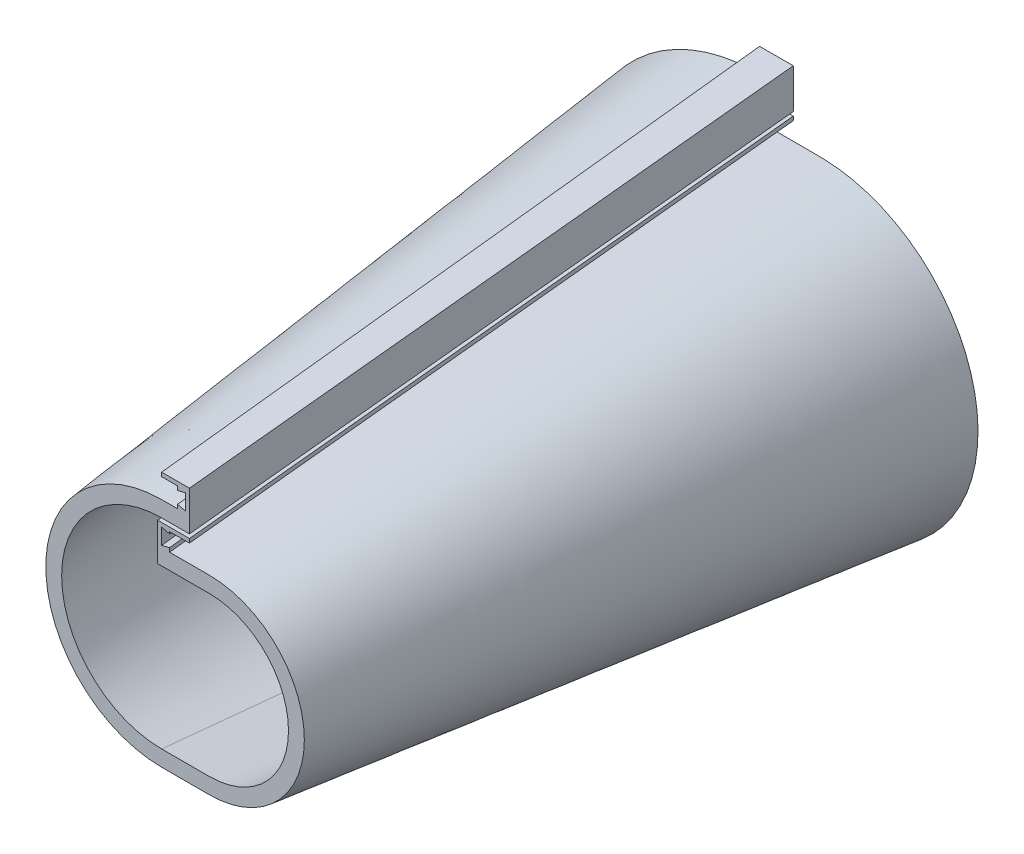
ISO-10303-21;
HEADER;
FILE_DESCRIPTION(('STEP AP214'),'2;1');
FILE_NAME('part.step','',(''),(''),'','','');
FILE_SCHEMA(('AUTOMOTIVE_DESIGN { 1 0 10303 214 1 1 1 1 }'));
ENDSEC;
DATA;
#1=APPLICATION_CONTEXT('core data for automotive mechanical design processes');
#2=APPLICATION_PROTOCOL_DEFINITION('international standard','automotive_design',2000,#1);
#3=PRODUCT_CONTEXT('',#1,'mechanical');
#4=PRODUCT('Part','Part','',(#3));
#5=PRODUCT_RELATED_PRODUCT_CATEGORY('part','',(#4));
#6=PRODUCT_DEFINITION_FORMATION('','',#4);
#7=PRODUCT_DEFINITION_CONTEXT('part definition',#1,'design');
#8=PRODUCT_DEFINITION('design','',#6,#7);
#9=PRODUCT_DEFINITION_SHAPE('','',#8);
#10=(LENGTH_UNIT() NAMED_UNIT(*) SI_UNIT(.MILLI.,.METRE.));
#11=(NAMED_UNIT(*) PLANE_ANGLE_UNIT() SI_UNIT($,.RADIAN.));
#12=(NAMED_UNIT(*) SI_UNIT($,.STERADIAN.) SOLID_ANGLE_UNIT());
#13=UNCERTAINTY_MEASURE_WITH_UNIT(LENGTH_MEASURE(1.E-05),#10,'distance_accuracy_value','');
#14=(GEOMETRIC_REPRESENTATION_CONTEXT(3) GLOBAL_UNCERTAINTY_ASSIGNED_CONTEXT((#13)) GLOBAL_UNIT_ASSIGNED_CONTEXT((#10,
#11,#12)) REPRESENTATION_CONTEXT('',''));
#15=CARTESIAN_POINT('',(0.,0.,0.));
#16=DIRECTION('',(0.,0.,1.));
#17=DIRECTION('',(1.,0.,0.));
#18=AXIS2_PLACEMENT_3D('',#15,#16,#17);
#19=CARTESIAN_POINT('',(0.,56.,-203.2));
#20=CARTESIAN_POINT('',(0.,34.5,0.));
#21=CARTESIAN_POINT('',(-0.666666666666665,56.,-203.2));
#22=CARTESIAN_POINT('',(-0.5,34.5,0.));
#23=CARTESIAN_POINT('',(-1.95951919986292,56.,-203.2));
#24=CARTESIAN_POINT('',(-1.53132183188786,34.5,0.));
#25=CARTESIAN_POINT('',(-3.86961363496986,56.,-203.2));
#26=CARTESIAN_POINT('',(-3.10344979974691,34.5,0.));
#27=CARTESIAN_POINT('',(-5.83110910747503,56.,-203.2));
#28=CARTESIAN_POINT('',(-4.61879209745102,34.5,0.));
#29=CARTESIAN_POINT('',(-7.23747988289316,56.,-203.2));
#30=CARTESIAN_POINT('',(-5.55419157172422,34.5,0.));
#31=CARTESIAN_POINT('',(-11.2976163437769,56.,-203.2));
#32=CARTESIAN_POINT('',(-7.9279559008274,34.5,0.));
#33=CARTESIAN_POINT('',(-17.9045072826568,55.355226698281,-203.2));
#34=CARTESIAN_POINT('',(-11.7770285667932,34.1177097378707,0.));
#35=CARTESIAN_POINT('',(-27.4672579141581,52.4711410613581,-203.2));
#36=CARTESIAN_POINT('',(-17.3100677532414,32.4297006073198,0.));
#37=CARTESIAN_POINT('',(-36.3072574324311,47.7666820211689,-203.2));
#38=CARTESIAN_POINT('',(-22.3943098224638,29.7006248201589,0.));
#39=CARTESIAN_POINT('',(-44.0742715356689,41.4126580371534,-203.2));
#40=CARTESIAN_POINT('',(-26.8404520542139,26.0404419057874,0.));
#41=CARTESIAN_POINT('',(-50.4578361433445,33.6491859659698,-203.2));
#42=CARTESIAN_POINT('',(-30.4841929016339,21.5920785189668,0.));
#43=CARTESIAN_POINT('',(-55.2015763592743,24.7756063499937,-203.2));
#44=CARTESIAN_POINT('',(-33.1914772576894,16.525871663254,0.));
#45=CARTESIAN_POINT('',(-58.1146751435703,15.1383684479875,-203.2));
#46=CARTESIAN_POINT('',(-34.8628625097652,11.0335745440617,0.));
#47=CARTESIAN_POINT('',(-59.0806329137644,5.1160987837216,-203.2));
#48=CARTESIAN_POINT('',(-35.4365865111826,5.32185405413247,0.));
#49=CARTESIAN_POINT('',(-58.0624425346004,-4.89666700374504,-203.2));
#50=CARTESIAN_POINT('',(-34.8906145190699,-0.39478979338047,0.));
#51=CARTESIAN_POINT('',(-55.1041346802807,-14.5066198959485,-203.2));
#52=CARTESIAN_POINT('',(-33.2434273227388,-5.90127585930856,0.));
#53=CARTESIAN_POINT('',(-50.3284516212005,-23.3386832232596,-203.2));
#54=CARTESIAN_POINT('',(-30.5535593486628,-10.9892239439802,0.));
#55=CARTESIAN_POINT('',(-43.9309687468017,-31.0519318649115,-203.2));
#56=CARTESIAN_POINT('',(-26.9178809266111,-15.4641754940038,0.));
#57=CARTESIAN_POINT('',(-36.1707708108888,-37.3539503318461,-203.2));
#58=CARTESIAN_POINT('',(-22.4687800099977,-19.1522824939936,0.));
#59=CARTESIAN_POINT('',(-27.3586245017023,-42.0122708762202,-203.2));
#60=CARTESIAN_POINT('',(-17.3700432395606,-21.9065785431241,0.));
#61=CARTESIAN_POINT('',(-17.8425168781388,-44.8636253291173,-203.2));
#62=CARTESIAN_POINT('',(-11.8117532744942,-23.612870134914,0.));
#63=CARTESIAN_POINT('',(-11.2761364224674,-45.5,-203.2));
#64=CARTESIAN_POINT('',(-7.94009975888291,-24.,0.));
#65=CARTESIAN_POINT('',(-6.4848935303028,-45.5,-203.2));
#66=CARTESIAN_POINT('',(-5.10276700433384,-24.,0.));
#67=CARTESIAN_POINT('',(-3.80022649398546,-45.5,-203.2));
#68=CARTESIAN_POINT('',(-3.16412231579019,-24.,0.));
#69=CARTESIAN_POINT('',(-0.0644247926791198,-45.5,-203.2));
#70=CARTESIAN_POINT('',(0.0762154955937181,-24.0000000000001,0.));
#71=CARTESIAN_POINT('',(3.69529819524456,-45.5,-203.2));
#72=CARTESIAN_POINT('',(3.26436056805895,-24.,0.));
#73=CARTESIAN_POINT('',(6.42740203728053,-45.5,-203.2));
#74=CARTESIAN_POINT('',(5.13527031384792,-24.,0.));
#75=CARTESIAN_POINT('',(10.9181518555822,-45.5,-203.2));
#76=CARTESIAN_POINT('',(7.60461389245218,-24.,0.));
#77=CARTESIAN_POINT('',(16.7762945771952,-44.9368037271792,-203.2));
#78=CARTESIAN_POINT('',(10.7996832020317,-23.6763848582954,0.));
#79=CARTESIAN_POINT('',(25.2927268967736,-42.3983416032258,-203.200000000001));
#80=CARTESIAN_POINT('',(15.3718957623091,-22.2667666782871,0.));
#81=CARTESIAN_POINT('',(33.2012781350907,-38.2339722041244,-203.2));
#82=CARTESIAN_POINT('',(19.5482487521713,-19.9952397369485,0.));
#83=CARTESIAN_POINT('',(40.1811250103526,-32.5814656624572,-203.2));
#84=CARTESIAN_POINT('',(23.1885771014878,-16.9724940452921,0.));
#85=CARTESIAN_POINT('',(45.942967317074,-25.6455470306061,-203.2));
#86=CARTESIAN_POINT('',(26.1527157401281,-13.3092196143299,0.));
#87=CARTESIAN_POINT('',(50.2440905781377,-17.6899611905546,-203.2));
#88=CARTESIAN_POINT('',(28.3513663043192,-9.15585541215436,0.));
#89=CARTESIAN_POINT('',(52.90105255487,-9.02634100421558,-203.2));
#90=CARTESIAN_POINT('',(29.6952304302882,-4.66284040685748,0.));
#91=CARTESIAN_POINT('',(53.799637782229,0.,-203.2));
#92=CARTESIAN_POINT('',(30.1534658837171,0.,0.));
#93=CARTESIAN_POINT('',(52.9010525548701,9.02634100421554,-203.2));
#94=CARTESIAN_POINT('',(29.6952304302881,4.6628404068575,0.));
#95=CARTESIAN_POINT('',(50.2440905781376,17.6899611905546,-203.2));
#96=CARTESIAN_POINT('',(28.3513663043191,9.15585541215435,0.));
#97=CARTESIAN_POINT('',(45.9429673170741,25.645547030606,-203.2));
#98=CARTESIAN_POINT('',(26.1527157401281,13.30921961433,0.));
#99=CARTESIAN_POINT('',(40.1811250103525,32.5814656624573,-203.2));
#100=CARTESIAN_POINT('',(23.1885771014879,16.9724940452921,0.));
#101=CARTESIAN_POINT('',(33.2012781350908,38.2339722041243,-203.2));
#102=CARTESIAN_POINT('',(19.5482487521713,19.9952397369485,0.));
#103=CARTESIAN_POINT('',(25.2927268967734,42.398341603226,-203.2));
#104=CARTESIAN_POINT('',(15.371895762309,22.266766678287,0.));
#105=CARTESIAN_POINT('',(16.7762945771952,44.9368037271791,-203.2));
#106=CARTESIAN_POINT('',(10.7996832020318,23.6763848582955,0.));
#107=CARTESIAN_POINT('',(10.9181518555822,45.5,-203.2));
#108=CARTESIAN_POINT('',(7.6046138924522,24.,0.));
#109=CARTESIAN_POINT('',(6.42740203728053,45.5,-203.2));
#110=CARTESIAN_POINT('',(5.13527031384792,24.,0.));
#111=CARTESIAN_POINT('',(3.5916079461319,45.5,-203.2));
#112=CARTESIAN_POINT('',(3.30303911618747,24.,0.));
#113=CARTESIAN_POINT('',(-0.313106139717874,45.5,-203.2));
#114=CARTESIAN_POINT('',(0.269867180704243,24.,0.));
#115=CARTESIAN_POINT('',(-4.09714466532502,45.5,-203.2));
#116=CARTESIAN_POINT('',(-2.9186453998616,24.,0.));
#117=CARTESIAN_POINT('',(-6.66666666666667,45.5,-203.2));
#118=CARTESIAN_POINT('',(-5.,24.,0.));
#119=CARTESIAN_POINT('',(-8.,45.5,-203.2));
#120=CARTESIAN_POINT('',(-6.,24.,0.));
#121=B_SPLINE_SURFACE_WITH_KNOTS('',3,1,((#19,#20),(#21,#22),(#23,#24),(#25,#26),(#27,#28),(#29,
#30),(#31,#32),(#33,#34),(#35,#36),(#37,#38),(#39,#40),(#41,#42),(#43,#44),(#45,#46),(#47,#48),
(#49,#50),(#51,#52),(#53,#54),(#55,#56),(#57,#58),(#59,#60),(#61,#62),(#63,#64),(#65,#66),(#67,
#68),(#69,#70),(#71,#72),(#73,#74),(#75,#76),(#77,#78),(#79,#80),(#81,#82),(#83,#84),(#85,#86),
(#87,#88),(#89,#90),(#91,#92),(#93,#94),(#95,#96),(#97,#98),(#99,#100),(#101,#102),(#103,#104),
(#105,#106),(#107,#108),(#109,#110),(#111,#112),(#113,#114),(#115,#116),(#117,#118),(#119,
#120)),.UNSPECIFIED.,.F.,.F.,.F.,(4,1,1,1,2,1,1,1,1,1,1,1,1,1,1,1,1,1,1,1,2,1,1,1,2,1,1,1,1,1,1,
1,1,1,1,1,1,1,1,1,2,1,1,1,4),(2,2),(0.,0.00673065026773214,0.0134613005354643,
0.0201919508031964,0.0269226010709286,0.0560301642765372,0.0851377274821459,0.114245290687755,
0.143352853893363,0.172460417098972,0.201567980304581,0.230675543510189,0.259783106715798,
0.288890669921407,0.317998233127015,0.347105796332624,0.376213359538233,0.405320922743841,
0.43442848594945,0.463536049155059,0.492643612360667,0.506104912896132,0.519566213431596,
0.53302751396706,0.546488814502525,0.571467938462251,0.596447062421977,0.621426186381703,
0.646405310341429,0.671384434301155,0.696363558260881,0.721342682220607,0.746321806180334,
0.77130093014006,0.796280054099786,0.821259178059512,0.846238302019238,0.871217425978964,
0.89619654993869,0.921175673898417,0.946154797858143,0.959616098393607,0.973077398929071,
0.986538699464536,1.),(0.,1.),.UNSPECIFIED.);
#122=CARTESIAN_POINT('',(-7.5,40.125,-152.4));
#123=CARTESIAN_POINT('',(-6.98486706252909,40.1249999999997,-152.4));
#124=CARTESIAN_POINT('',(-6.46973412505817,40.1249999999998,-152.4));
#125=CARTESIAN_POINT('',(-5.43849251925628,40.1250000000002,-152.4));
#126=CARTESIAN_POINT('',(-4.9223838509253,40.1250000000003,-152.4));
#127=CARTESIAN_POINT('',(-3.88938741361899,40.1249999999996,-152.4));
#128=CARTESIAN_POINT('',(-3.37249964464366,40.1249999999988,-152.4));
#129=CARTESIAN_POINT('',(-2.33814163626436,40.1250000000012,-152.4));
#130=CARTESIAN_POINT('',(-1.82067139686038,40.1250000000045,-152.4));
#131=CARTESIAN_POINT('',(-0.78534507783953,40.1249999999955,-152.4));
#132=CARTESIAN_POINT('',(-0.267488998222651,40.1249999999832,-152.4));
#133=CARTESIAN_POINT('',(0.768412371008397,40.1250000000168,-152.4));
#134=CARTESIAN_POINT('',(1.28645766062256,40.1250000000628,-152.4));
#135=CARTESIAN_POINT('',(2.06863137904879,40.124999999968,-152.4));
#136=CARTESIAN_POINT('',(2.33275980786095,40.1249999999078,-152.4));
#137=CARTESIAN_POINT('',(2.86101701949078,40.1250000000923,-152.4));
#138=CARTESIAN_POINT('',(3.12514580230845,40.1250000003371,-152.4));
#139=CARTESIAN_POINT('',(3.65333927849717,40.124999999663,-152.4));
#140=CARTESIAN_POINT('',(3.91740397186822,40.1249999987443,-152.4));
#141=CARTESIAN_POINT('',(4.44553203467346,40.1250000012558,-152.4));
#142=CARTESIAN_POINT('',(4.70959540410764,40.1250000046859,-152.4));
#143=CARTESIAN_POINT('',(5.23758021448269,40.1249999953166,-152.4));
#144=CARTESIAN_POINT('',(5.50150165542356,40.124999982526,-152.4));
#145=CARTESIAN_POINT('',(5.89738643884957,40.1250000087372,-152.4));
#146=CARTESIAN_POINT('',(6.02934978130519,40.1250000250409,-152.4));
#147=CARTESIAN_POINT('',(6.29327616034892,40.1249999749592,-152.4));
#148=CARTESIAN_POINT('',(6.42523919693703,40.1249999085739,-152.4));
#149=CARTESIAN_POINT('',(6.68905234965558,40.1250000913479,-152.4));
#150=CARTESIAN_POINT('',(6.82090246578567,40.1250003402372,-152.4));
#151=CARTESIAN_POINT('',(7.01867820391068,40.12499982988,-152.4));
#152=CARTESIAN_POINT('',(7.08460382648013,40.1249995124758,-152.4));
#153=CARTESIAN_POINT('',(7.21645508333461,40.1250004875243,-152.4));
#154=CARTESIAN_POINT('',(7.28238071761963,40.1250017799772,-152.4));
#155=CARTESIAN_POINT('',(7.38126818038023,40.1249991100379,-152.4));
#156=CARTESIAN_POINT('',(7.41423001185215,40.1249974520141,-152.4));
#157=CARTESIAN_POINT('',(7.48015367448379,40.1250025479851,-152.4));
#158=CARTESIAN_POINT('',(7.51311550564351,40.125009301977,-152.4));
#159=CARTESIAN_POINT('',(7.61200062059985,40.1249017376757,-152.4));
#160=CARTESIAN_POINT('',(7.67792383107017,40.1246595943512,-152.4));
#161=CARTESIAN_POINT('',(7.80976707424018,40.1238533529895,-152.4));
#162=CARTESIAN_POINT('',(7.87568710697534,40.1232892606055,-152.4));
#163=CARTESIAN_POINT('',(8.00752383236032,40.121834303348,-152.4));
#164=CARTESIAN_POINT('',(8.07344052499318,40.1209434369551,-152.4));
#165=CARTESIAN_POINT('',(8.27104537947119,40.1177849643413,-152.4));
#166=CARTESIAN_POINT('',(8.40272610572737,40.1150306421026,-152.4));
#167=CARTESIAN_POINT('',(8.66605589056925,40.108223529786,-152.4));
#168=CARTESIAN_POINT('',(8.79770494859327,40.1041707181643,-152.4));
#169=CARTESIAN_POINT('',(9.06096174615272,40.0947680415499,-152.4));
#170=CARTESIAN_POINT('',(9.19256948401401,40.0894181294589,-152.4));
#171=CARTESIAN_POINT('',(9.45572531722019,40.0774226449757,-152.4));
#172=CARTESIAN_POINT('',(9.58727341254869,40.0707770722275,-152.4));
#173=CARTESIAN_POINT('',(9.98181135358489,40.0488986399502,-152.4));
#174=CARTESIAN_POINT('',(10.2446968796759,40.0317239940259,-152.4));
#175=CARTESIAN_POINT('',(10.7700802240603,39.9922077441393,-152.4));
#176=CARTESIAN_POINT('',(11.0325780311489,39.9698659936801,-152.4));
#177=CARTESIAN_POINT('',(11.8579294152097,39.8914366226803,-152.4));
#178=CARTESIAN_POINT('',(12.4199292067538,39.8260365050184,-152.4));
#179=CARTESIAN_POINT('',(13.5410570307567,39.6715096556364,-152.4));
#180=CARTESIAN_POINT('',(14.1001826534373,39.5823655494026,-152.4));
#181=CARTESIAN_POINT('',(15.2143733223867,39.380411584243,-152.4));
#182=CARTESIAN_POINT('',(15.7694367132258,39.2675925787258,-152.4));
#183=CARTESIAN_POINT('',(16.8743106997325,39.0185363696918,-152.4));
#184=CARTESIAN_POINT('',(17.4241210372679,38.8822980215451,-152.4));
#185=CARTESIAN_POINT('',(18.5134454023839,38.5878028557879,-152.4));
#186=CARTESIAN_POINT('',(19.0530055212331,38.4297165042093,-152.4));
#187=CARTESIAN_POINT('',(20.124950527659,38.0910662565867,-152.4));
#188=CARTESIAN_POINT('',(20.6573363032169,37.9105051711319,-152.4));
#189=CARTESIAN_POINT('',(21.7140133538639,37.527175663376,-152.4));
#190=CARTESIAN_POINT('',(22.2383052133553,37.3244088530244,-152.4));
#191=CARTESIAN_POINT('',(23.2778518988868,36.8969468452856,-152.4));
#192=CARTESIAN_POINT('',(23.7931068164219,36.6722518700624,-152.4));
#193=CARTESIAN_POINT('',(24.9850688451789,36.122360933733,-152.4));
#194=CARTESIAN_POINT('',(25.6579128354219,35.7887476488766,-152.4));
#195=CARTESIAN_POINT('',(26.9838714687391,35.084386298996,-152.4));
#196=CARTESIAN_POINT('',(27.6369855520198,34.7136371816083,-152.4));
#197=CARTESIAN_POINT('',(28.9214164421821,33.9360943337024,-152.4));
#198=CARTESIAN_POINT('',(29.5527330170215,33.5293002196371,-152.4));
#199=CARTESIAN_POINT('',(30.7937184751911,32.6793920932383,-152.4));
#200=CARTESIAN_POINT('',(31.4033021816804,32.2361537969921,-152.4));
#201=CARTESIAN_POINT('',(32.5966466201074,31.3161080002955,-152.4));
#202=CARTESIAN_POINT('',(33.1804072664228,30.839300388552,-152.4));
#203=CARTESIAN_POINT('',(34.0351441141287,30.1001206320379,-152.4));
#204=CARTESIAN_POINT('',(34.3165692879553,29.8497356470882,-152.4));
#205=CARTESIAN_POINT('',(34.8723195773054,29.3410771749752,-152.4));
#206=CARTESIAN_POINT('',(35.1466431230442,29.0828019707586,-152.4));
#207=CARTESIAN_POINT('',(35.8228691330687,28.4278457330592,-152.4));
#208=CARTESIAN_POINT('',(36.220158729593,28.0263847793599,-152.4));
#209=CARTESIAN_POINT('',(36.9974465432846,27.2069786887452,-152.4));
#210=CARTESIAN_POINT('',(37.3774425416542,26.7890314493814,-152.4));
#211=CARTESIAN_POINT('',(38.1195145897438,25.9374458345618,-152.4));
#212=CARTESIAN_POINT('',(38.4815889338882,25.503805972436,-152.4));
#213=CARTESIAN_POINT('',(39.1871276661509,24.6216775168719,-152.4));
#214=CARTESIAN_POINT('',(39.5305928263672,24.1731895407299,-152.4));
#215=CARTESIAN_POINT('',(40.1978584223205,23.2627199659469,-152.4));
#216=CARTESIAN_POINT('',(40.5216845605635,22.8007572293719,-152.4));
#217=CARTESIAN_POINT('',(41.149519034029,21.8635970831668,-152.4));
#218=CARTESIAN_POINT('',(41.4535267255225,21.3883992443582,-152.4));
#219=CARTESIAN_POINT('',(42.3351200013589,19.9442084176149,-152.4));
#220=CARTESIAN_POINT('',(42.8824403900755,18.9563934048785,-152.4));
#221=CARTESIAN_POINT('',(43.6394746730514,17.4431581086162,-152.4));
#222=CARTESIAN_POINT('',(43.8811900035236,16.9334233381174,-152.4));
#223=CARTESIAN_POINT('',(44.3428678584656,15.9041897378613,-152.4));
#224=CARTESIAN_POINT('',(44.5628309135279,15.3846911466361,-152.4));
#225=CARTESIAN_POINT('',(45.1894302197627,13.8129845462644,-152.4));
#226=CARTESIAN_POINT('',(45.5628819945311,12.747355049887,-152.4));
#227=CARTESIAN_POINT('',(46.2190162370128,10.5881219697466,-152.4));
#228=CARTESIAN_POINT('',(46.5016691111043,9.49450939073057,-152.4));
#229=CARTESIAN_POINT('',(46.8556685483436,7.8393931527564,-152.4));
#230=CARTESIAN_POINT('',(46.9620129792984,7.28517574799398,-152.4));
#231=CARTESIAN_POINT('',(47.1512345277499,6.17271206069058,-152.4));
#232=CARTESIAN_POINT('',(47.234111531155,5.61446575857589,-152.4));
#233=CARTESIAN_POINT('',(47.3762420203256,4.49539000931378,-152.4));
#234=CARTESIAN_POINT('',(47.4355123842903,3.93456269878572,-152.4));
#235=CARTESIAN_POINT('',(47.530402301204,2.81090977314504,-152.4));
#236=CARTESIAN_POINT('',(47.5660219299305,2.24808416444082,-152.4));
#237=CARTESIAN_POINT('',(47.6134954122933,1.12143313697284,-152.4));
#238=CARTESIAN_POINT('',(47.6253493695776,0.55760772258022,-152.4));
#239=CARTESIAN_POINT('',(47.6251740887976,-0.570039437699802,-152.4));
#240=CARTESIAN_POINT('',(47.6131448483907,-1.13386118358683,-152.4));
#241=CARTESIAN_POINT('',(47.5653188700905,-2.26056876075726,-152.4));
#242=CARTESIAN_POINT('',(47.5295190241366,-2.8234544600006,-152.4));
#243=CARTESIAN_POINT('',(47.4342634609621,-3.94721953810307,-152.4));
#244=CARTESIAN_POINT('',(47.3748076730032,-4.50809891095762,-152.4));
#245=CARTESIAN_POINT('',(47.2323512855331,-5.62687687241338,-152.4));
#246=CARTESIAN_POINT('',(47.1493503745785,-6.18477542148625,-152.4));
#247=CARTESIAN_POINT('',(46.959908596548,-7.29654125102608,-152.4));
#248=CARTESIAN_POINT('',(46.8534678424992,-7.85040855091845,-152.4));
#249=CARTESIAN_POINT('',(46.499104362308,-9.50502579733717,-152.4));
#250=CARTESIAN_POINT('',(46.2161801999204,-10.5984786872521,-152.4));
#251=CARTESIAN_POINT('',(45.5594211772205,-12.7577104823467,-152.4));
#252=CARTESIAN_POINT('',(45.185587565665,-13.8234897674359,-152.4));
#253=CARTESIAN_POINT('',(44.5585682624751,-15.3949441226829,-152.4));
#254=CARTESIAN_POINT('',(44.3385974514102,-15.9140657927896,-152.4));
#255=CARTESIAN_POINT('',(43.8769314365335,-16.9425540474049,-152.4));
#256=CARTESIAN_POINT('',(43.6352357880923,-17.4519204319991,-152.4));
#257=CARTESIAN_POINT('',(42.8782956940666,-18.9640931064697,-152.4));
#258=CARTESIAN_POINT('',(42.3311069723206,-19.9512010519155,-152.4));
#259=CARTESIAN_POINT('',(41.3519986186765,-21.5544371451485,-152.4));
#260=CARTESIAN_POINT('',(40.9425292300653,-22.184460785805,-152.4));
#261=CARTESIAN_POINT('',(40.0887861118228,-23.4205412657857,-152.4));
#262=CARTESIAN_POINT('',(39.6445127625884,-24.0265983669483,-152.4));
#263=CARTESIAN_POINT('',(38.7227375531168,-25.2128367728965,-152.4));
#264=CARTESIAN_POINT('',(38.2452366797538,-25.7930188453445,-152.4));
#265=CARTESIAN_POINT('',(37.2571377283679,-26.9272411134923,-152.4));
#266=CARTESIAN_POINT('',(36.7464541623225,-27.4812068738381,-152.4));
#267=CARTESIAN_POINT('',(35.6946005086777,-28.5594135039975,-152.4));
#268=CARTESIAN_POINT('',(35.1534297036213,-29.0836536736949,-152.4));
#269=CARTESIAN_POINT('',(34.0423446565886,-30.1008563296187,-152.4));
#270=CARTESIAN_POINT('',(33.4724281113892,-30.5938163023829,-152.4));
#271=CARTESIAN_POINT('',(32.4509472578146,-31.4283766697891,-152.4));
#272=CARTESIAN_POINT('',(32.0052012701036,-31.7771285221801,-152.4));
#273=CARTESIAN_POINT('',(31.0993777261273,-32.4555084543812,-152.4));
#274=CARTESIAN_POINT('',(30.6393003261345,-32.7851367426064,-152.4));
#275=CARTESIAN_POINT('',(29.7056539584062,-33.4245809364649,-152.4));
#276=CARTESIAN_POINT('',(29.2320864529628,-33.734398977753,-152.4));
#277=CARTESIAN_POINT('',(28.2723663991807,-34.3336646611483,-152.4));
#278=CARTESIAN_POINT('',(27.7862164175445,-34.6231164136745,-152.4));
#279=CARTESIAN_POINT('',(26.8055288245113,-35.1793257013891,-152.4));
#280=CARTESIAN_POINT('',(26.3110721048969,-35.4462258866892,-152.4));
#281=CARTESIAN_POINT('',(25.3113864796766,-35.9590759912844,-152.4));
#282=CARTESIAN_POINT('',(24.8061571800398,-36.2050251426,-152.4));
#283=CARTESIAN_POINT('',(23.7856742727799,-36.6755524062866,-152.4));
#284=CARTESIAN_POINT('',(23.2704179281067,-36.9001245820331,-152.4));
#285=CARTESIAN_POINT('',(22.2306074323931,-37.3274515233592,-152.4));
#286=CARTESIAN_POINT('',(21.7060484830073,-37.5301946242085,-152.4));
#287=CARTESIAN_POINT('',(20.7551706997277,-37.8749085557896,-152.4));
#288=CARTESIAN_POINT('',(20.3303045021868,-38.0209024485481,-152.4));
#289=CARTESIAN_POINT('',(19.4758983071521,-38.2985635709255,-152.4));
#290=CARTESIAN_POINT('',(19.0463581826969,-38.4302304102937,-152.4));
#291=CARTESIAN_POINT('',(18.183243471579,-38.6790498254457,-152.4));
#292=CARTESIAN_POINT('',(17.7496702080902,-38.7962069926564,-152.4));
#293=CARTESIAN_POINT('',(16.8791271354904,-39.0158438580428,-152.4));
#294=CARTESIAN_POINT('',(16.4421597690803,-39.1183332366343,-152.4));
#295=CARTESIAN_POINT('',(15.5654708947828,-39.3084780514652,-152.4));
#296=CARTESIAN_POINT('',(15.1257526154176,-39.3961483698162,-152.4));
#297=CARTESIAN_POINT('',(14.2386750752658,-39.5575734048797,-152.4));
#298=CARTESIAN_POINT('',(13.7912854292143,-39.6311610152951,-152.4));
#299=CARTESIAN_POINT('',(12.8942655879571,-39.76314516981,-152.4));
#300=CARTESIAN_POINT('',(12.4446354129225,-39.82154185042,-152.4));
#301=CARTESIAN_POINT('',(11.7688533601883,-39.8977083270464,-152.4));
#302=CARTESIAN_POINT('',(11.5433317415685,-39.921195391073,-152.4));
#303=CARTESIAN_POINT('',(11.091918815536,-39.9643500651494,-152.4));
#304=CARTESIAN_POINT('',(10.8660275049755,-39.9840176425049,-152.4));
#305=CARTESIAN_POINT('',(10.4138041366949,-40.0195371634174,-152.4));
#306=CARTESIAN_POINT('',(10.1874718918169,-40.0353867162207,-152.4));
#307=CARTESIAN_POINT('',(9.73457361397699,-40.0632475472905,-152.4));
#308=CARTESIAN_POINT('',(9.50800758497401,-40.0752588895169,-152.4));
#309=CARTESIAN_POINT('',(9.16792565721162,-40.0903973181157,-152.4));
#310=CARTESIAN_POINT('',(9.05447211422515,-40.0949651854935,-152.4));
#311=CARTESIAN_POINT('',(8.82752934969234,-40.1031367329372,-152.4));
#312=CARTESIAN_POINT('',(8.71404012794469,-40.1067404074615,-152.4));
#313=CARTESIAN_POINT('',(8.48703412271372,-40.1129846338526,-152.4));
#314=CARTESIAN_POINT('',(8.3735173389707,-40.1156251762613,-152.4));
#315=CARTESIAN_POINT('',(8.1464668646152,-40.1199349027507,-152.4));
#316=CARTESIAN_POINT('',(8.03293317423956,-40.1216040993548,-152.4));
#317=CARTESIAN_POINT('',(7.82625205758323,-40.1237826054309,-152.4));
#318=CARTESIAN_POINT('',(7.73310628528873,-40.1244464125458,-152.4));
#319=CARTESIAN_POINT('',(7.54681210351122,-40.1250636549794,-152.4));
#320=CARTESIAN_POINT('',(7.45366369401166,-40.1250170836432,-152.4));
#321=CARTESIAN_POINT('',(7.26736559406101,-40.1249829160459,-152.4));
#322=CARTESIAN_POINT('',(7.17421590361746,-40.1249953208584,-152.4));
#323=CARTESIAN_POINT('',(6.98791680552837,-40.1250046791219,-152.4));
#324=CARTESIAN_POINT('',(6.89476739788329,-40.1250016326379,-152.4));
#325=CARTESIAN_POINT('',(6.61531407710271,-40.1249967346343,-152.4));
#326=CARTESIAN_POINT('',(6.42901019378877,-40.1249991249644,-152.4));
#327=CARTESIAN_POINT('',(6.05640410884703,-40.1250008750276,-152.4));
#328=CARTESIAN_POINT('',(5.87010190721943,-40.1250002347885,-152.4));
#329=CARTESIAN_POINT('',(5.49758028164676,-40.1249997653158,-152.4));
#330=CARTESIAN_POINT('',(5.31136085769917,-40.124999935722,-152.4));
#331=CARTESIAN_POINT('',(4.93892155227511,-40.1250000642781,-152.4));
#332=CARTESIAN_POINT('',(4.75270167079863,-40.1250000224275,-152.4));
#333=CARTESIAN_POINT('',(4.19404673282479,-40.1249999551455,-152.4));
#334=CARTESIAN_POINT('',(3.82161167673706,-40.1249999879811,-152.4));
#335=CARTESIAN_POINT('',(3.07671831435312,-40.1250000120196,-152.4));
#336=CARTESIAN_POINT('',(2.7042600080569,-40.1250000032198,-152.4));
#337=CARTESIAN_POINT('',(1.959342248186,-40.1249999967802,-152.4));
#338=CARTESIAN_POINT('',(1.58688279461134,-40.1249999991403,-152.4));
#339=CARTESIAN_POINT('',(0.841758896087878,-40.1250000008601,-152.4));
#340=CARTESIAN_POINT('',(0.469094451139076,-40.1250000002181,-152.4));
#341=CARTESIAN_POINT('',(-0.276234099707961,-40.1249999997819,-152.4));
#342=CARTESIAN_POINT('',(-0.648898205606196,-40.1249999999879,-152.4));
#343=CARTESIAN_POINT('',(-1.39461557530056,-40.1250000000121,-152.4));
#344=CARTESIAN_POINT('',(-1.76766883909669,-40.12499999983,-152.4));
#345=CARTESIAN_POINT('',(-2.51377557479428,-40.12500000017,-152.4));
#346=CARTESIAN_POINT('',(-2.88682904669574,-40.125000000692,-152.4));
#347=CARTESIAN_POINT('',(-3.63350892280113,-40.1249999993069,-152.4));
#348=CARTESIAN_POINT('',(-4.00713532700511,-40.124999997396,-152.4));
#349=CARTESIAN_POINT('',(-4.56757473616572,-40.125000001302,-152.4));
#350=CARTESIAN_POINT('',(-4.7543877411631,-40.1250000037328,-152.4));
#351=CARTESIAN_POINT('',(-5.12801365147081,-40.1249999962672,-152.4));
#352=CARTESIAN_POINT('',(-5.31482655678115,-40.1249999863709,-152.4));
#353=CARTESIAN_POINT('',(-5.68736860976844,-40.12500001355,-152.4));
#354=CARTESIAN_POINT('',(-5.87309775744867,-40.1250000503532,-152.4));
#355=CARTESIAN_POINT('',(-6.24455642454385,-40.1249999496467,-152.4));
#356=CARTESIAN_POINT('',(-6.4302859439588,-40.1249998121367,-152.4));
#357=CARTESIAN_POINT('',(-6.70888089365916,-40.1250000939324,-152.4));
#358=CARTESIAN_POINT('',(-6.80174632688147,-40.1250002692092,-152.4));
#359=CARTESIAN_POINT('',(-6.98747737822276,-40.1249997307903,-152.4));
#360=CARTESIAN_POINT('',(-7.08034299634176,-40.1249990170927,-152.4));
#361=CARTESIAN_POINT('',(-7.26607386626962,-40.1250009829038,-152.4));
#362=CARTESIAN_POINT('',(-7.35893911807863,-40.1250036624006,-152.4));
#363=CARTESIAN_POINT('',(-7.49823695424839,-40.1249981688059,-152.4));
#364=CARTESIAN_POINT('',(-7.54466948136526,-40.1249947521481,-152.4));
#365=CARTESIAN_POINT('',(-7.63753421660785,-40.124821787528,-152.4));
#366=CARTESIAN_POINT('',(-7.68396642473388,-40.1246522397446,-152.4));
#367=CARTESIAN_POINT('',(-7.82313579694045,-40.1239362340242,-152.4));
#368=CARTESIAN_POINT('',(-7.91587197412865,-40.1231825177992,-152.4));
#369=CARTESIAN_POINT('',(-8.10133821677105,-40.1211009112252,-152.4));
#370=CARTESIAN_POINT('',(-8.19406828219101,-40.1197730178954,-152.4));
#371=CARTESIAN_POINT('',(-8.47224313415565,-40.1149364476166,-152.4));
#372=CARTESIAN_POINT('',(-8.65767380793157,-40.1105748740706,-152.4));
#373=CARTESIAN_POINT('',(-9.02845981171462,-40.0995761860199,-152.4));
#374=CARTESIAN_POINT('',(-9.21381514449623,-40.0929391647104,-152.4));
#375=CARTESIAN_POINT('',(-9.58443057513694,-40.0773933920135,-152.4));
#376=CARTESIAN_POINT('',(-9.76969067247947,-40.0684846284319,-152.4));
#377=CARTESIAN_POINT('',(-10.3242365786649,-40.0384111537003,-152.4));
#378=CARTESIAN_POINT('',(-10.693345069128,-40.0138678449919,-152.4));
#379=CARTESIAN_POINT('',(-11.4308665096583,-39.9557753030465,-152.4));
#380=CARTESIAN_POINT('',(-11.7992794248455,-39.922225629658,-152.4));
#381=CARTESIAN_POINT('',(-12.5344657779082,-39.8462150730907,-152.4));
#382=CARTESIAN_POINT('',(-12.901241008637,-39.803771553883,-152.4));
#383=CARTESIAN_POINT('',(-13.6336384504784,-39.709956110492,-152.4));
#384=CARTESIAN_POINT('',(-13.9992606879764,-39.6585843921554,-152.4));
#385=CARTESIAN_POINT('',(-14.7287684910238,-39.5469900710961,-152.4));
#386=CARTESIAN_POINT('',(-15.0926554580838,-39.486776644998,-152.4));
#387=CARTESIAN_POINT('',(-15.8188447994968,-39.3574792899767,-152.4));
#388=CARTESIAN_POINT('',(-16.1811471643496,-39.2883953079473,-152.4));
#389=CARTESIAN_POINT('',(-17.2652306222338,-39.0679079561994,-152.4));
#390=CARTESIAN_POINT('',(-17.9843572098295,-38.9032433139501,-152.4));
#391=CARTESIAN_POINT('',(-19.5209860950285,-38.5117607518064,-152.4));
#392=CARTESIAN_POINT('',(-20.3370577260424,-38.2793240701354,-152.4));
#393=CARTESIAN_POINT('',(-21.9569190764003,-37.7685372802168,-152.4));
#394=CARTESIAN_POINT('',(-22.7606734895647,-37.4900752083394,-152.4));
#395=CARTESIAN_POINT('',(-24.3517684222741,-36.8881655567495,-152.4));
#396=CARTESIAN_POINT('',(-25.1390977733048,-36.5646884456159,-152.4));
#397=CARTESIAN_POINT('',(-26.6952921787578,-35.8734747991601,-152.4));
#398=CARTESIAN_POINT('',(-27.4641320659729,-35.5056816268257,-152.4));
#399=CARTESIAN_POINT('',(-28.9791746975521,-34.7278713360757,-152.4));
#400=CARTESIAN_POINT('',(-29.7253998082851,-34.3178978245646,-152.4));
#401=CARTESIAN_POINT('',(-31.1933694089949,-33.4568348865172,-152.4));
#402=CARTESIAN_POINT('',(-31.9151207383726,-33.0057570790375,-152.4));
#403=CARTESIAN_POINT('',(-33.6857719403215,-31.8283780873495,-152.4));
#404=CARTESIAN_POINT('',(-34.7182422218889,-31.0770414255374,-152.4));
#405=CARTESIAN_POINT('',(-36.2166587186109,-29.8871181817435,-152.4));
#406=CARTESIAN_POINT('',(-36.7078847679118,-29.4798632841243,-152.4));
#407=CARTESIAN_POINT('',(-37.6727889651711,-28.6450063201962,-152.4));
#408=CARTESIAN_POINT('',(-38.1464674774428,-28.2174046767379,-152.4));
#409=CARTESIAN_POINT('',(-39.0753302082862,-27.3425938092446,-152.4));
#410=CARTESIAN_POINT('',(-39.5305146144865,-26.8953847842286,-152.4));
#411=CARTESIAN_POINT('',(-40.4215794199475,-25.982121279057,-152.4));
#412=CARTESIAN_POINT('',(-40.8574596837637,-25.5160666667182,-152.4));
#413=CARTESIAN_POINT('',(-41.7091533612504,-24.5660710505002,-152.4));
#414=CARTESIAN_POINT('',(-42.1249691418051,-24.0821321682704,-152.4));
#415=CARTESIAN_POINT('',(-42.9358633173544,-23.0971827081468,-152.4));
#416=CARTESIAN_POINT('',(-43.330941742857,-22.5961721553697,-152.4));
#417=CARTESIAN_POINT('',(-44.0997243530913,-21.5778501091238,-152.4));
#418=CARTESIAN_POINT('',(-44.4734241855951,-21.0605353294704,-152.4));
#419=CARTESIAN_POINT('',(-45.1986124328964,-20.0105690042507,-152.4));
#420=CARTESIAN_POINT('',(-45.5501008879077,-19.4779174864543,-152.4));
#421=CARTESIAN_POINT('',(-46.2302949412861,-18.3982254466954,-152.4));
#422=CARTESIAN_POINT('',(-46.5589997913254,-17.8511844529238,-152.4));
#423=CARTESIAN_POINT('',(-47.1930695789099,-16.7437828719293,-152.4));
#424=CARTESIAN_POINT('',(-47.4984344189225,-16.1834222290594,-152.4));
#425=CARTESIAN_POINT('',(-48.3785804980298,-14.4840702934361,-152.4));
#426=CARTESIAN_POINT('',(-48.9177006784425,-13.3263526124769,-152.4));
#427=CARTESIAN_POINT('',(-49.8961724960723,-10.9695126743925,-152.4));
#428=CARTESIAN_POINT('',(-50.3355252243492,-9.77039087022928,-152.4));
#429=CARTESIAN_POINT('',(-50.9176359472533,-7.94775763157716,-152.4));
#430=CARTESIAN_POINT('',(-51.0988385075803,-7.33628530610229,-152.4));
#431=CARTESIAN_POINT('',(-51.4353617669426,-6.10622031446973,-152.4));
#432=CARTESIAN_POINT('',(-51.5906825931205,-5.4876276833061,-152.4));
#433=CARTESIAN_POINT('',(-51.8750741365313,-4.24444411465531,-152.4));
#434=CARTESIAN_POINT('',(-52.0041447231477,-3.61985314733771,-152.4));
#435=CARTESIAN_POINT('',(-52.235783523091,-2.36577200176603,-152.4));
#436=CARTESIAN_POINT('',(-52.3383516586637,-1.73628180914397,-152.4));
#437=CARTESIAN_POINT('',(-52.5169083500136,-0.473470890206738,-152.4));
#438=CARTESIAN_POINT('',(-52.5928938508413,0.159850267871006,-152.4));
#439=CARTESIAN_POINT('',(-52.7181488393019,1.42912876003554,-152.4));
#440=CARTESIAN_POINT('',(-52.7674183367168,2.06508609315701,-152.4));
#441=CARTESIAN_POINT('',(-52.8391344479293,3.33851458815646,-152.4));
#442=CARTESIAN_POINT('',(-52.8615810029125,3.97598575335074,-152.4));
#443=CARTESIAN_POINT('',(-52.8795100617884,5.25130350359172,-152.4));
#444=CARTESIAN_POINT('',(-52.8749926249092,5.88915008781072,-152.4));
#445=CARTESIAN_POINT('',(-52.8390434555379,7.1641778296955,-152.4));
#446=CARTESIAN_POINT('',(-52.807608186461,7.80135888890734,-152.4));
#447=CARTESIAN_POINT('',(-52.7179531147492,9.07379542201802,-152.4));
#448=CARTESIAN_POINT('',(-52.6597331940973,9.70905088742,-152.4));
#449=CARTESIAN_POINT('',(-52.4450429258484,11.6102390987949,-152.4));
#450=CARTESIAN_POINT('',(-52.2485339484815,12.8718796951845,-152.4));
#451=CARTESIAN_POINT('',(-51.7496612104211,15.3738283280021,-152.4));
#452=CARTESIAN_POINT('',(-51.4473157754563,16.6141400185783,-152.4));
#453=CARTESIAN_POINT('',(-50.9165387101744,18.4519688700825,-152.4));
#454=CARTESIAN_POINT('',(-50.7267110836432,19.0608719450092,-152.4));
#455=CARTESIAN_POINT('',(-50.3215871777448,20.2701863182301,-152.4));
#456=CARTESIAN_POINT('',(-50.106291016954,20.8705976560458,-152.4));
#457=CARTESIAN_POINT('',(-49.650474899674,22.0619888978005,-152.4));
#458=CARTESIAN_POINT('',(-49.4099464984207,22.6529655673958,-152.4));
#459=CARTESIAN_POINT('',(-48.9041228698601,23.8242272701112,-152.4));
#460=CARTESIAN_POINT('',(-48.6388275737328,24.404512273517,-152.4));
#461=CARTESIAN_POINT('',(-48.0840337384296,25.5533943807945,-152.4));
#462=CARTESIAN_POINT('',(-47.7945351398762,26.1219914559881,-152.4));
#463=CARTESIAN_POINT('',(-47.1918621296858,27.2464965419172,-152.4));
#464=CARTESIAN_POINT('',(-46.8786877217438,27.8024045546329,-152.4));
#465=CARTESIAN_POINT('',(-46.2290420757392,28.9008079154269,-152.4));
#466=CARTESIAN_POINT('',(-45.8925594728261,29.4432965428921,-152.4));
#467=CARTESIAN_POINT('',(-45.1969516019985,30.5135530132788,-152.4));
#468=CARTESIAN_POINT('',(-44.8378263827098,31.0413208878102,-152.4));
#469=CARTESIAN_POINT('',(-44.0976073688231,32.0812170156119,-152.4));
#470=CARTESIAN_POINT('',(-43.7165139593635,32.593345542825,-152.4));
#471=CARTESIAN_POINT('',(-42.933122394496,33.6010693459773,-152.4));
#472=CARTESIAN_POINT('',(-42.5308241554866,34.0966645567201,-152.4));
#473=CARTESIAN_POINT('',(-41.2932593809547,35.5572435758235,-152.4));
#474=CARTESIAN_POINT('',(-40.4270925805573,36.496344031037,-152.4));
#475=CARTESIAN_POINT('',(-38.6184252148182,38.2980057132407,-152.4));
#476=CARTESIAN_POINT('',(-37.6759208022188,39.1605630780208,-152.4));
#477=CARTESIAN_POINT('',(-36.2111254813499,40.3919656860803,-152.4));
#478=CARTESIAN_POINT('',(-35.7146204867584,40.7918393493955,-152.4));
#479=CARTESIAN_POINT('',(-34.7051872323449,41.5703814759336,-152.4));
#480=CARTESIAN_POINT('',(-34.1922586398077,41.9490495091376,-152.4));
#481=CARTESIAN_POINT('',(-33.1509544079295,42.6843576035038,-152.4));
#482=CARTESIAN_POINT('',(-32.622580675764,43.041000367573,-152.4));
#483=CARTESIAN_POINT('',(-31.5512904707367,43.7316236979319,-152.4));
#484=CARTESIAN_POINT('',(-31.0083753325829,44.0656063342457,-152.4));
#485=CARTESIAN_POINT('',(-29.909441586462,44.7101595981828,-152.4));
#486=CARTESIAN_POINT('',(-29.3534344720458,45.0207498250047,-152.4));
#487=CARTESIAN_POINT('',(-28.2288419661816,45.6183080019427,-152.4));
#488=CARTESIAN_POINT('',(-27.6602561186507,45.9052750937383,-152.4));
#489=CARTESIAN_POINT('',(-26.5113939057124,46.4551133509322,-152.4));
#490=CARTESIAN_POINT('',(-25.9311149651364,46.7179791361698,-152.4));
#491=CARTESIAN_POINT('',(-24.7597330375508,47.219090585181,-152.4));
#492=CARTESIAN_POINT('',(-24.1686256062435,47.4573258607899,-152.4));
#493=CARTESIAN_POINT('',(-22.97534442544,47.9092513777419,-152.4));
#494=CARTESIAN_POINT('',(-22.3731458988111,48.1228761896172,-152.4));
#495=CARTESIAN_POINT('',(-21.1603182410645,48.5245351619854,-152.4));
#496=CARTESIAN_POINT('',(-20.5496896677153,48.7125710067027,-152.4));
#497=CARTESIAN_POINT('',(-19.3213866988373,49.0626402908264,-152.4));
#498=CARTESIAN_POINT('',(-18.7037163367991,49.2246878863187,-152.4));
#499=CARTESIAN_POINT('',(-17.4627175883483,49.5224197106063,-152.4));
#500=CARTESIAN_POINT('',(-16.8393956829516,49.6581309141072,-152.4));
#501=CARTESIAN_POINT('',(-15.6801904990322,49.8849463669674,-152.4));
#502=CARTESIAN_POINT('',(-15.1450132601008,49.9796795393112,-152.4));
#503=CARTESIAN_POINT('',(-14.0715814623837,50.1498603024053,-152.4));
#504=CARTESIAN_POINT('',(-13.5333268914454,50.2253078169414,-152.4));
#505=CARTESIAN_POINT('',(-12.7240555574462,50.3239773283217,-152.4));
#506=CARTESIAN_POINT('',(-12.4539039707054,50.3544570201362,-152.4));
#507=CARTESIAN_POINT('',(-11.9130960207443,50.4105642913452,-152.4));
#508=CARTESIAN_POINT('',(-11.6424396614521,50.4361919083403,-152.4));
#509=CARTESIAN_POINT('',(-11.1004204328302,50.4826117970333,-152.4));
#510=CARTESIAN_POINT('',(-10.8290571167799,50.5033988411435,-152.4));
#511=CARTESIAN_POINT('',(-10.2859949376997,50.5400924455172,-152.4));
#512=CARTESIAN_POINT('',(-10.0142960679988,50.5559989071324,-152.4));
#513=CARTESIAN_POINT('',(-9.47021031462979,50.58295141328,-152.4));
#514=CARTESIAN_POINT('',(-9.19782303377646,50.5939894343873,-152.4));
#515=CARTESIAN_POINT('',(-8.65290487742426,50.6111314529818,-152.4));
#516=CARTESIAN_POINT('',(-8.38037400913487,50.6172356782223,-152.4));
#517=CARTESIAN_POINT('',(-7.97236106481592,50.6227483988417,-152.4));
#518=CARTESIAN_POINT('',(-7.83690181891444,50.623980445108,-152.4));
#519=CARTESIAN_POINT('',(-7.56597742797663,50.625122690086,-152.4));
#520=CARTESIAN_POINT('',(-7.43051228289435,50.6250328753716,-152.4));
#521=CARTESIAN_POINT('',(-7.15957946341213,50.6249671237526,-152.4));
#522=CARTESIAN_POINT('',(-7.02411178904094,50.6249911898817,-152.4));
#523=CARTESIAN_POINT('',(-6.75317687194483,50.6250088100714,-152.4));
#524=CARTESIAN_POINT('',(-6.61770962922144,50.6250023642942,-152.4));
#525=CARTESIAN_POINT('',(-6.34679023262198,50.6249976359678,-152.4));
#526=CARTESIAN_POINT('',(-6.21133807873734,50.6249993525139,-152.4));
#527=CARTESIAN_POINT('',(-5.94043355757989,50.6250006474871,-152.4));
#528=CARTESIAN_POINT('',(-5.80498119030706,50.6250002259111,-152.4));
#529=CARTESIAN_POINT('',(-5.39862798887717,50.6249995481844,-152.4));
#530=CARTESIAN_POINT('',(-5.12772716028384,50.6249998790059,-152.4));
#531=CARTESIAN_POINT('',(-4.58625827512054,50.6250001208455,-152.4));
#532=CARTESIAN_POINT('',(-4.31569021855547,50.6250000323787,-152.4));
#533=CARTESIAN_POINT('',(-3.77455309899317,50.6249999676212,-152.4));
#534=CARTESIAN_POINT('',(-3.50398403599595,50.6249999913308,-152.4));
#535=CARTESIAN_POINT('',(-2.96348843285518,50.6250000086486,-152.4));
#536=CARTESIAN_POINT('',(-2.69356189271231,50.6250000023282,-152.4));
#537=CARTESIAN_POINT('',(-2.15370914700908,50.6249999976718,-152.4));
#538=CARTESIAN_POINT('',(-1.88378294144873,50.6249999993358,-152.4));
#539=CARTESIAN_POINT('',(-1.34488077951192,50.6250000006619,-152.4));
#540=CARTESIAN_POINT('',(-1.07590482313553,50.6250000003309,-152.4));
#541=CARTESIAN_POINT('',(-0.537952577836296,50.6249999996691,-152.4));
#542=CARTESIAN_POINT('',(-0.268976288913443,50.6249999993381,-152.4));
#543=CARTESIAN_POINT('',(0.,50.625,-152.4));
#544=B_SPLINE_CURVE_WITH_KNOTS('',3,(#122,#123,#124,#125,#126,#127,#128,#129,#130,#131,#132,
#133,#134,#135,#136,#137,#138,#139,#140,#141,#142,#143,#144,#145,#146,#147,#148,#149,#150,#151,
#152,#153,#154,#155,#156,#157,#158,#159,#160,#161,#162,#163,#164,#165,#166,#167,#168,#169,#170,
#171,#172,#173,#174,#175,#176,#177,#178,#179,#180,#181,#182,#183,#184,#185,#186,#187,#188,#189,
#190,#191,#192,#193,#194,#195,#196,#197,#198,#199,#200,#201,#202,#203,#204,#205,#206,#207,#208,
#209,#210,#211,#212,#213,#214,#215,#216,#217,#218,#219,#220,#221,#222,#223,#224,#225,#226,#227,
#228,#229,#230,#231,#232,#233,#234,#235,#236,#237,#238,#239,#240,#241,#242,#243,#244,#245,#246,
#247,#248,#249,#250,#251,#252,#253,#254,#255,#256,#257,#258,#259,#260,#261,#262,#263,#264,#265,
#266,#267,#268,#269,#270,#271,#272,#273,#274,#275,#276,#277,#278,#279,#280,#281,#282,#283,#284,
#285,#286,#287,#288,#289,#290,#291,#292,#293,#294,#295,#296,#297,#298,#299,#300,#301,#302,#303,
#304,#305,#306,#307,#308,#309,#310,#311,#312,#313,#314,#315,#316,#317,#318,#319,#320,#321,#322,
#323,#324,#325,#326,#327,#328,#329,#330,#331,#332,#333,#334,#335,#336,#337,#338,#339,#340,#341,
#342,#343,#344,#345,#346,#347,#348,#349,#350,#351,#352,#353,#354,#355,#356,#357,#358,#359,#360,
#361,#362,#363,#364,#365,#366,#367,#368,#369,#370,#371,#372,#373,#374,#375,#376,#377,#378,#379,
#380,#381,#382,#383,#384,#385,#386,#387,#388,#389,#390,#391,#392,#393,#394,#395,#396,#397,#398,
#399,#400,#401,#402,#403,#404,#405,#406,#407,#408,#409,#410,#411,#412,#413,#414,#415,#416,#417,
#418,#419,#420,#421,#422,#423,#424,#425,#426,#427,#428,#429,#430,#431,#432,#433,#434,#435,#436,
#437,#438,#439,#440,#441,#442,#443,#444,#445,#446,#447,#448,#449,#450,#451,#452,#453,#454,#455,
#456,#457,#458,#459,#460,#461,#462,#463,#464,#465,#466,#467,#468,#469,#470,#471,#472,#473,#474,
#475,#476,#477,#478,#479,#480,#481,#482,#483,#484,#485,#486,#487,#488,#489,#490,#491,#492,#493,
#494,#495,#496,#497,#498,#499,#500,#501,#502,#503,#504,#505,#506,#507,#508,#509,#510,#511,#512,
#513,#514,#515,#516,#517,#518,#519,#520,#521,#522,#523,#524,#525,#526,#527,#528,#529,#530,#531,
#532,#533,#534,#535,#536,#537,#538,#539,#540,#541,#542,#543),.UNSPECIFIED.,.F.,.F.,(4,2,2,2,2,2,
2,2,2,2,2,2,2,2,2,2,2,2,2,2,2,2,2,2,2,2,2,2,2,2,2,2,2,2,2,2,2,2,2,2,2,2,2,2,2,2,2,2,2,2,2,2,2,2,
2,2,2,2,2,2,2,2,2,2,2,2,2,2,2,2,2,2,2,2,2,2,2,2,2,2,2,2,2,2,2,2,2,2,2,2,2,2,2,2,2,2,2,2,2,2,2,2,
2,2,2,2,2,2,2,2,2,2,2,2,2,2,2,2,2,2,2,2,2,2,2,2,2,2,2,2,2,2,2,2,2,2,2,2,2,2,2,2,2,2,2,2,2,2,2,2,
2,2,2,2,2,2,2,2,2,2,2,2,2,2,2,2,2,2,2,2,2,2,2,2,2,2,2,2,2,2,2,2,2,2,2,2,2,2,2,2,2,2,2,2,2,2,2,2,
2,2,2,2,2,2,2,2,2,2,2,2,4),(0.,1.54539881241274,3.09372481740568,4.64438812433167,
6.19679884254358,7.75036708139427,9.30450295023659,10.0968882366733,10.8892745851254,
11.6814686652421,12.4736587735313,13.2654230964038,13.661313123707,14.0572022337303,
14.4527525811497,14.6505294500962,14.8483063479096,14.9471918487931,15.0460773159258,
15.243847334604,15.4416138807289,15.6393813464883,16.034502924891,16.4296310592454,
16.8247735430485,17.2199161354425,18.0101952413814,18.8004967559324,20.4973196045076,
22.195387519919,23.8941126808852,25.592920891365,27.2791530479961,28.965174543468,
30.651073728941,32.3369558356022,34.5887541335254,36.8406162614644,39.0925023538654,
41.3524146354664,43.6123344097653,44.7422685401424,45.8724503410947,47.5663446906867,
49.2604557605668,50.9547277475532,52.6489293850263,54.3408636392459,56.0328528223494,
59.415998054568,61.1080271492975,62.8000149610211,66.1832862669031,69.5676591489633,
71.2602219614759,72.9527930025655,74.6441517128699,76.3355050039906,78.0268509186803,
79.7181969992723,81.4097642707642,83.1013366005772,84.7929313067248,86.4845178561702,
89.8686326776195,93.25270101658,94.943660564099,96.6346547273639,100.015908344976,
102.269068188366,104.522203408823,106.775271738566,109.034394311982,111.29357007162,
113.552927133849,115.250351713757,116.947757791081,118.644980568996,120.341859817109,
122.027045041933,123.712292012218,125.398005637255,127.084615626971,128.432124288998,
129.779669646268,131.126787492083,132.473012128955,133.817876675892,135.177825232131,
136.537761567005,137.217959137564,137.898162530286,138.578790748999,139.259407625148,
139.600040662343,139.940675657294,140.281313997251,140.621947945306,140.901389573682,
141.180833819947,141.460283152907,141.739731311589,142.298643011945,142.857549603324,
143.416207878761,143.974867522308,145.092172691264,146.209547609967,147.32692597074,
148.444919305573,149.562911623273,150.682071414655,151.801231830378,152.922111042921,
153.482550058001,154.042988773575,154.600176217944,155.157364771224,155.43596107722,
155.714557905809,155.993153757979,156.132451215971,156.271748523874,156.549964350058,
156.828181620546,157.384612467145,157.941020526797,158.497431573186,159.60708191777,
160.716786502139,161.824344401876,162.931876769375,164.038267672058,165.14466519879,
167.356947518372,169.901197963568,172.451731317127,175.003945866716,177.559457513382,
180.112353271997,182.664529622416,186.489981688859,188.403819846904,190.317618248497,
192.231397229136,194.145189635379,196.058755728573,197.972319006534,199.88627046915,
201.800218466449,203.714229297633,205.628248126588,209.454672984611,213.281055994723,
215.193855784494,217.106646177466,219.019446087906,220.932251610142,222.845276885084,
224.758301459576,226.671330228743,228.584354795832,230.497630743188,232.410915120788,
236.23662816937,240.061679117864,241.974630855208,243.887573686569,245.801158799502,
247.714749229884,249.628344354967,251.541939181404,253.456473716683,255.371004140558,
257.285501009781,259.200005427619,263.02782751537,266.855842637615,268.767898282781,
270.679992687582,272.591851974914,274.503536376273,276.413600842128,278.323734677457,
280.23429388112,282.145655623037,284.061987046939,285.978192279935,287.893350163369,
289.806535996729,291.436694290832,293.066859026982,293.882420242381,294.697975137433,
295.514406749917,296.330854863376,297.148643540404,297.966394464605,298.372783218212,
298.779176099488,299.185579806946,299.591981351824,299.99833786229,300.40469495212,
301.217397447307,302.029101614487,302.840808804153,303.650588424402,304.46036704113,
305.26729491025,306.074223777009),.UNSPECIFIED.);
#545=CARTESIAN_POINT('',(-5.5,40.125,-152.4));
#546=VERTEX_POINT('',#545);
#547=CARTESIAN_POINT('',(-1.99999999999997,50.625,-152.4));
#548=VERTEX_POINT('',#547);
#549=EDGE_CURVE('E368',#546,#548,#544,.T.);
#550=DIRECTION('',(0.00978741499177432,-0.105214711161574,0.994401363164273));
#551=VECTOR('',#550,1.);
#552=CARTESIAN_POINT('',(-5.5,40.125,-152.4));
#553=LINE('',#552,#551);
#554=CARTESIAN_POINT('',(-3.99994999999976,24.,0.));
#555=VERTEX_POINT('',#554);
#556=EDGE_CURVE('E363',#546,#555,#553,.T.);
#557=DIRECTION('',(1.,0.,0.));
#558=VECTOR('',#557,1.);
#559=CARTESIAN_POINT('',(0.,24.,0.));
#560=LINE('',#559,#558);
#561=CARTESIAN_POINT('',(6.00000000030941,24.,0.));
#562=VERTEX_POINT('',#561);
#563=EDGE_CURVE('E606',#555,#562,#560,.T.);
#564=CARTESIAN_POINT('',(6.,0.,0.));
#565=DIRECTION('',(0.,0.,1.));
#566=DIRECTION('',(1.,0.,0.));
#567=AXIS2_PLACEMENT_3D('',#564,#565,#566);
#568=CIRCLE('',#567,24.);
#569=CARTESIAN_POINT('',(6.00000000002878,-24.,0.));
#570=VERTEX_POINT('',#569);
#571=EDGE_CURVE('E611',#562,#570,#568,.F.);
#572=DIRECTION('',(-1.,0.,0.));
#573=VECTOR('',#572,1.);
#574=CARTESIAN_POINT('',(0.,-24.,0.));
#575=LINE('',#574,#573);
#576=CARTESIAN_POINT('',(-6.00000000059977,-24.,0.));
#577=VERTEX_POINT('',#576);
#578=EDGE_CURVE('E1376',#570,#577,#575,.T.);
#579=CARTESIAN_POINT('',(-6.,5.25,0.));
#580=DIRECTION('',(0.,0.,1.));
#581=DIRECTION('',(1.,0.,0.));
#582=AXIS2_PLACEMENT_3D('',#579,#580,#581);
#583=CIRCLE('',#582,29.25);
#584=CARTESIAN_POINT('',(-5.99999999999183,34.5,0.));
#585=VERTEX_POINT('',#584);
#586=EDGE_CURVE('E1346',#577,#585,#583,.F.);
#587=DIRECTION('',(-1.,0.,0.));
#588=VECTOR('',#587,1.);
#589=CARTESIAN_POINT('',(0.,34.5,0.));
#590=LINE('',#589,#588);
#591=CARTESIAN_POINT('',(-2.,34.5,0.));
#592=VERTEX_POINT('',#591);
#593=EDGE_CURVE('E1344',#592,#585,#590,.T.);
#594=DIRECTION('',(0.,-0.10521975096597,0.994448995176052));
#595=VECTOR('',#594,1.);
#596=CARTESIAN_POINT('',(-2.,56.,-203.2));
#597=LINE('',#596,#595);
#598=EDGE_CURVE('E1208',#548,#592,#597,.T.);
#599=ORIENTED_EDGE('',*,*,#549,.F.);
#600=ORIENTED_EDGE('',*,*,#556,.T.);
#601=ORIENTED_EDGE('',*,*,#563,.T.);
#602=ORIENTED_EDGE('',*,*,#571,.T.);
#603=ORIENTED_EDGE('',*,*,#578,.T.);
#604=ORIENTED_EDGE('',*,*,#586,.T.);
#605=ORIENTED_EDGE('',*,*,#593,.F.);
#606=ORIENTED_EDGE('',*,*,#598,.F.);
#607=EDGE_LOOP('',(#599,#600,#601,#602,#603,#604,#605,#606));
#608=FACE_BOUND('',#607,.T.);
#609=ADVANCED_FACE('F344',(#608),#121,.T.);
#610=CARTESIAN_POINT('',(0.,0.,0.));
#611=DIRECTION('',(0.,0.,-1.));
#612=DIRECTION('',(-1.,0.,0.));
#613=AXIS2_PLACEMENT_3D('',#610,#611,#612);
#614=PLANE('',#613);
#615=ORIENTED_EDGE('',*,*,#563,.F.);
#616=DIRECTION('',(0.,1.,0.));
#617=VECTOR('',#616,1.);
#618=CARTESIAN_POINT('',(-4.00000000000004,0.,0.));
#619=LINE('',#618,#617);
#620=CARTESIAN_POINT('',(-4.,25.,0.));
#621=VERTEX_POINT('',#620);
#622=EDGE_CURVE('E569',#555,#621,#619,.T.);
#623=ORIENTED_EDGE('',*,*,#622,.T.);
#624=DIRECTION('',(0.970142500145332,0.242535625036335,0.));
#625=VECTOR('',#624,1.);
#626=CARTESIAN_POINT('',(-6.11764705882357,24.4705882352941,0.));
#627=LINE('',#626,#625);
#628=CARTESIAN_POINT('',(-6.,24.5,0.));
#629=VERTEX_POINT('',#628);
#630=EDGE_CURVE('E557',#629,#621,#627,.T.);
#631=ORIENTED_EDGE('',*,*,#630,.F.);
#632=DIRECTION('',(0.,-1.,0.));
#633=VECTOR('',#632,1.);
#634=CARTESIAN_POINT('',(-6.,0.,0.));
#635=LINE('',#634,#633);
#636=CARTESIAN_POINT('',(-6.,28.5,0.));
#637=VERTEX_POINT('',#636);
#638=EDGE_CURVE('E636',#637,#629,#635,.T.);
#639=ORIENTED_EDGE('',*,*,#638,.F.);
#640=DIRECTION('',(0.970142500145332,-0.242535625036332,0.));
#641=VECTOR('',#640,1.);
#642=CARTESIAN_POINT('',(6.35294117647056,25.4117647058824,0.));
#643=LINE('',#642,#641);
#644=CARTESIAN_POINT('',(-4.,28.,0.));
#645=VERTEX_POINT('',#644);
#646=EDGE_CURVE('E643',#637,#645,#643,.T.);
#647=ORIENTED_EDGE('',*,*,#646,.T.);
#648=DIRECTION('',(0.,-1.,0.));
#649=VECTOR('',#648,1.);
#650=CARTESIAN_POINT('',(-4.,0.,0.));
#651=LINE('',#650,#649);
#652=CARTESIAN_POINT('',(-4.,28.5,0.));
#653=VERTEX_POINT('',#652);
#654=EDGE_CURVE('E661',#653,#645,#651,.T.);
#655=ORIENTED_EDGE('',*,*,#654,.F.);
#656=DIRECTION('',(-1.,0.,0.));
#657=VECTOR('',#656,1.);
#658=CARTESIAN_POINT('',(0.,28.5,0.));
#659=LINE('',#658,#657);
#660=CARTESIAN_POINT('',(1.,28.5,0.));
#661=VERTEX_POINT('',#660);
#662=EDGE_CURVE('E657',#661,#653,#659,.T.);
#663=ORIENTED_EDGE('',*,*,#662,.F.);
#664=DIRECTION('',(0.,-1.,0.));
#665=VECTOR('',#664,1.);
#666=CARTESIAN_POINT('',(1.,0.,0.));
#667=LINE('',#666,#665);
#668=CARTESIAN_POINT('',(1.,29.5,0.));
#669=VERTEX_POINT('',#668);
#670=EDGE_CURVE('E653',#669,#661,#667,.T.);
#671=ORIENTED_EDGE('',*,*,#670,.F.);
#672=DIRECTION('',(1.,0.,0.));
#673=VECTOR('',#672,1.);
#674=CARTESIAN_POINT('',(0.,29.5,0.));
#675=LINE('',#674,#673);
#676=CARTESIAN_POINT('',(-7.,29.5,0.));
#677=VERTEX_POINT('',#676);
#678=EDGE_CURVE('E649',#677,#669,#675,.T.);
#679=ORIENTED_EDGE('',*,*,#678,.F.);
#680=DIRECTION('',(0.,1.,0.));
#681=VECTOR('',#680,1.);
#682=CARTESIAN_POINT('',(-7.,0.,0.));
#683=LINE('',#682,#681);
#684=CARTESIAN_POINT('',(-7.,20.,0.));
#685=VERTEX_POINT('',#684);
#686=EDGE_CURVE('E637',#685,#677,#683,.T.);
#687=ORIENTED_EDGE('',*,*,#686,.F.);
#688=DIRECTION('',(-1.,0.,0.));
#689=VECTOR('',#688,1.);
#690=CARTESIAN_POINT('',(0.,20.,0.));
#691=LINE('',#690,#689);
#692=CARTESIAN_POINT('',(-6.,20.,0.));
#693=VERTEX_POINT('',#692);
#694=EDGE_CURVE('E633',#693,#685,#691,.T.);
#695=ORIENTED_EDGE('',*,*,#694,.F.);
#696=DIRECTION('',(1.,0.,0.));
#697=VECTOR('',#696,1.);
#698=CARTESIAN_POINT('',(0.,20.,0.));
#699=LINE('',#698,#697);
#700=CARTESIAN_POINT('',(5.99999999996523,20.,0.));
#701=VERTEX_POINT('',#700);
#702=EDGE_CURVE('E624',#693,#701,#699,.T.);
#703=ORIENTED_EDGE('',*,*,#702,.T.);
#704=CARTESIAN_POINT('',(6.,0.,0.));
#705=DIRECTION('',(0.,0.,1.));
#706=DIRECTION('',(1.,0.,0.));
#707=AXIS2_PLACEMENT_3D('',#704,#705,#706);
#708=CIRCLE('',#707,20.);
#709=CARTESIAN_POINT('',(5.99999999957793,-20.,0.));
#710=VERTEX_POINT('',#709);
#711=EDGE_CURVE('E628',#701,#710,#708,.F.);
#712=ORIENTED_EDGE('',*,*,#711,.T.);
#713=DIRECTION('',(-1.,0.,0.));
#714=VECTOR('',#713,1.);
#715=CARTESIAN_POINT('',(0.,-20.,0.));
#716=LINE('',#715,#714);
#717=CARTESIAN_POINT('',(-6.,-20.,0.));
#718=VERTEX_POINT('',#717);
#719=EDGE_CURVE('E1461',#710,#718,#716,.T.);
#720=ORIENTED_EDGE('',*,*,#719,.T.);
#721=CARTESIAN_POINT('',(-6.,5.25,0.));
#722=DIRECTION('',(0.,0.,1.));
#723=DIRECTION('',(1.,0.,0.));
#724=AXIS2_PLACEMENT_3D('',#721,#722,#723);
#725=CIRCLE('',#724,25.25);
#726=CARTESIAN_POINT('',(-6.00000000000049,30.5,0.));
#727=VERTEX_POINT('',#726);
#728=EDGE_CURVE('E1450',#727,#718,#725,.T.);
#729=ORIENTED_EDGE('',*,*,#728,.F.);
#730=DIRECTION('',(-1.,0.,0.));
#731=VECTOR('',#730,1.);
#732=CARTESIAN_POINT('',(0.,30.5,0.));
#733=LINE('',#732,#731);
#734=CARTESIAN_POINT('',(0.,30.5,0.));
#735=VERTEX_POINT('',#734);
#736=EDGE_CURVE('E1349',#735,#727,#733,.T.);
#737=ORIENTED_EDGE('',*,*,#736,.F.);
#738=DIRECTION('',(1.,0.,0.));
#739=VECTOR('',#738,1.);
#740=CARTESIAN_POINT('',(0.,30.5,0.));
#741=LINE('',#740,#739);
#742=CARTESIAN_POINT('',(1.,30.5,0.));
#743=VERTEX_POINT('',#742);
#744=EDGE_CURVE('E1104',#735,#743,#741,.T.);
#745=ORIENTED_EDGE('',*,*,#744,.T.);
#746=DIRECTION('',(0.,1.,0.));
#747=VECTOR('',#746,1.);
#748=CARTESIAN_POINT('',(1.,39.5,0.));
#749=LINE('',#748,#747);
#750=CARTESIAN_POINT('',(1.,34.9444444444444,0.));
#751=VERTEX_POINT('',#750);
#752=EDGE_CURVE('E1106',#743,#751,#749,.T.);
#753=ORIENTED_EDGE('',*,*,#752,.T.);
#754=CARTESIAN_POINT('',(1.,39.3888888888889,0.));
#755=VERTEX_POINT('',#754);
#756=EDGE_CURVE('E1089',#751,#755,#749,.T.);
#757=ORIENTED_EDGE('',*,*,#756,.T.);
#758=CARTESIAN_POINT('',(1.,40.5,0.));
#759=VERTEX_POINT('',#758);
#760=EDGE_CURVE('E1098',#755,#759,#749,.T.);
#761=ORIENTED_EDGE('',*,*,#760,.T.);
#762=DIRECTION('',(-1.,0.,0.));
#763=VECTOR('',#762,1.);
#764=CARTESIAN_POINT('',(1.,40.5,0.));
#765=LINE('',#764,#763);
#766=CARTESIAN_POINT('',(-6.,40.5,0.));
#767=VERTEX_POINT('',#766);
#768=EDGE_CURVE('E1114',#759,#767,#765,.T.);
#769=ORIENTED_EDGE('',*,*,#768,.T.);
#770=DIRECTION('',(0.,-1.,0.));
#771=VECTOR('',#770,1.);
#772=CARTESIAN_POINT('',(-6.,34.5,0.));
#773=LINE('',#772,#771);
#774=CARTESIAN_POINT('',(-6.,39.5,0.));
#775=VERTEX_POINT('',#774);
#776=EDGE_CURVE('E355',#767,#775,#773,.T.);
#777=ORIENTED_EDGE('',*,*,#776,.T.);
#778=DIRECTION('',(1.,0.,0.));
#779=VECTOR('',#778,1.);
#780=CARTESIAN_POINT('',(0.,39.5,0.));
#781=LINE('',#780,#779);
#782=CARTESIAN_POINT('',(-2.,39.5,0.));
#783=VERTEX_POINT('',#782);
#784=EDGE_CURVE('E1155',#775,#783,#781,.T.);
#785=ORIENTED_EDGE('',*,*,#784,.T.);
#786=DIRECTION('',(0.,-1.,0.));
#787=VECTOR('',#786,1.);
#788=CARTESIAN_POINT('',(-2.,0.,0.));
#789=LINE('',#788,#787);
#790=CARTESIAN_POINT('',(-2.,38.5,0.));
#791=VERTEX_POINT('',#790);
#792=EDGE_CURVE('E1164',#783,#791,#789,.T.);
#793=ORIENTED_EDGE('',*,*,#792,.T.);
#794=DIRECTION('',(-0.970142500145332,-0.242535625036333,0.));
#795=VECTOR('',#794,1.);
#796=CARTESIAN_POINT('',(-9.1764705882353,36.7058823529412,0.));
#797=LINE('',#796,#795);
#798=CARTESIAN_POINT('',(0.,39.,0.));
#799=VERTEX_POINT('',#798);
#800=EDGE_CURVE('E1174',#799,#791,#797,.T.);
#801=ORIENTED_EDGE('',*,*,#800,.F.);
#802=DIRECTION('',(0.,-1.,0.));
#803=VECTOR('',#802,1.);
#804=CARTESIAN_POINT('',(0.,0.,0.));
#805=LINE('',#804,#803);
#806=CARTESIAN_POINT('',(0.,35.,0.));
#807=VERTEX_POINT('',#806);
#808=EDGE_CURVE('E1178',#799,#807,#805,.T.);
#809=ORIENTED_EDGE('',*,*,#808,.T.);
#810=DIRECTION('',(0.970142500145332,-0.242535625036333,0.));
#811=VECTOR('',#810,1.);
#812=CARTESIAN_POINT('',(8.23529411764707,32.9411764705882,0.));
#813=LINE('',#812,#811);
#814=CARTESIAN_POINT('',(-2.,35.5,0.));
#815=VERTEX_POINT('',#814);
#816=EDGE_CURVE('E1183',#815,#807,#813,.T.);
#817=ORIENTED_EDGE('',*,*,#816,.F.);
#818=DIRECTION('',(0.,1.,0.));
#819=VECTOR('',#818,1.);
#820=CARTESIAN_POINT('',(-1.99999999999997,0.,0.));
#821=LINE('',#820,#819);
#822=EDGE_CURVE('E1163',#592,#815,#821,.T.);
#823=ORIENTED_EDGE('',*,*,#822,.F.);
#824=ORIENTED_EDGE('',*,*,#593,.T.);
#825=ORIENTED_EDGE('',*,*,#586,.F.);
#826=ORIENTED_EDGE('',*,*,#578,.F.);
#827=ORIENTED_EDGE('',*,*,#571,.F.);
#828=EDGE_LOOP('',(#615,#623,#631,#639,#647,#655,#663,#671,#679,#687,#695,#703,#712,#720,#729,
#737,#745,#753,#757,#761,#769,#777,#785,#793,#801,#809,#817,#823,#824,#825,#826,#827));
#829=FACE_BOUND('',#828,.T.);
#830=ADVANCED_FACE('F346',(#829),#614,.F.);
#831=CARTESIAN_POINT('',(1.,52.,-203.2));
#832=DIRECTION('',(1.,0.,0.));
#833=DIRECTION('',(0.,1.,0.));
#834=AXIS2_PLACEMENT_3D('',#831,#832,#833);
#835=PLANE('',#834);
#836=DIRECTION('',(0.,-1.,0.));
#837=VECTOR('',#836,1.);
#838=CARTESIAN_POINT('',(1.,52.,-152.4));
#839=LINE('',#838,#837);
#840=CARTESIAN_POINT('',(1.,56.625,-152.4));
#841=VERTEX_POINT('',#840);
#842=CARTESIAN_POINT('',(1.,46.625,-152.4));
#843=VERTEX_POINT('',#842);
#844=EDGE_CURVE('E1255',#841,#843,#839,.T.);
#845=ORIENTED_EDGE('',*,*,#844,.F.);
#846=DIRECTION('',(0.,-0.10521975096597,0.994448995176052));
#847=VECTOR('',#846,1.);
#848=CARTESIAN_POINT('',(1.,51.25,-101.6));
#849=LINE('',#848,#847);
#850=EDGE_CURVE('E1100',#841,#759,#849,.T.);
#851=ORIENTED_EDGE('',*,*,#850,.T.);
#852=ORIENTED_EDGE('',*,*,#760,.F.);
#853=ORIENTED_EDGE('',*,*,#756,.F.);
#854=ORIENTED_EDGE('',*,*,#752,.F.);
#855=DIRECTION('',(0.,0.10521975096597,-0.994448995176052));
#856=VECTOR('',#855,1.);
#857=CARTESIAN_POINT('',(1.,41.25,-101.6));
#858=LINE('',#857,#856);
#859=EDGE_CURVE('E1177',#743,#843,#858,.T.);
#860=ORIENTED_EDGE('',*,*,#859,.T.);
#861=EDGE_LOOP('',(#845,#851,#852,#853,#854,#860));
#862=FACE_BOUND('',#861,.T.);
#863=ADVANCED_FACE('F1048',(#862),#835,.T.);
#864=CARTESIAN_POINT('',(1.,62.,-203.2));
#865=DIRECTION('',(0.,0.994448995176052,0.10521975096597));
#866=DIRECTION('',(-1.,0.,0.));
#867=AXIS2_PLACEMENT_3D('',#864,#865,#866);
#868=PLANE('',#867);
#869=DIRECTION('',(1.,0.,0.));
#870=VECTOR('',#869,1.);
#871=CARTESIAN_POINT('',(1.,56.625,-152.4));
#872=LINE('',#871,#870);
#873=CARTESIAN_POINT('',(-7.49999999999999,56.625,-152.4));
#874=VERTEX_POINT('',#873);
#875=EDGE_CURVE('E1300',#874,#841,#872,.T.);
#876=ORIENTED_EDGE('',*,*,#875,.F.);
#877=DIRECTION('',(0.00978741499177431,-0.105214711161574,0.994401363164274));
#878=VECTOR('',#877,1.);
#879=CARTESIAN_POINT('',(-7.,51.25,-101.6));
#880=LINE('',#879,#878);
#881=EDGE_CURVE('E1109',#874,#767,#880,.T.);
#882=ORIENTED_EDGE('',*,*,#881,.T.);
#883=ORIENTED_EDGE('',*,*,#768,.F.);
#884=ORIENTED_EDGE('',*,*,#850,.F.);
#885=EDGE_LOOP('',(#876,#882,#883,#884));
#886=FACE_BOUND('',#885,.T.);
#887=ADVANCED_FACE('F1052',(#886),#868,.T.);
#888=CARTESIAN_POINT('',(0.,52.,-203.2));
#889=DIRECTION('',(0.,-0.994448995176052,-0.10521975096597));
#890=DIRECTION('',(1.,0.,0.));
#891=AXIS2_PLACEMENT_3D('',#888,#889,#890);
#892=PLANE('',#891);
#893=DIRECTION('',(-1.,0.,0.));
#894=VECTOR('',#893,1.);
#895=CARTESIAN_POINT('',(0.,46.625,-152.4));
#896=LINE('',#895,#894);
#897=CARTESIAN_POINT('',(0.,46.625,-152.4));
#898=VERTEX_POINT('',#897);
#899=EDGE_CURVE('E1201',#843,#898,#896,.T.);
#900=ORIENTED_EDGE('',*,*,#899,.F.);
#901=ORIENTED_EDGE('',*,*,#859,.F.);
#902=ORIENTED_EDGE('',*,*,#744,.F.);
#903=DIRECTION('',(0.,-0.10521975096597,0.994448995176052));
#904=VECTOR('',#903,1.);
#905=CARTESIAN_POINT('',(0.,41.25,-101.6));
#906=LINE('',#905,#904);
#907=EDGE_CURVE('E1254',#898,#735,#906,.T.);
#908=ORIENTED_EDGE('',*,*,#907,.F.);
#909=EDGE_LOOP('',(#900,#901,#902,#908));
#910=FACE_BOUND('',#909,.T.);
#911=ADVANCED_FACE('F1058',(#910),#892,.T.);
#912=CARTESIAN_POINT('',(-7.99999999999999,62.,-203.2));
#913=DIRECTION('',(-0.999951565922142,0.,0.00984204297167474));
#914=DIRECTION('',(0.,-1.,0.));
#915=AXIS2_PLACEMENT_3D('',#912,#913,#914);
#916=PLANE('',#915);
#917=DIRECTION('',(0.,1.,0.));
#918=VECTOR('',#917,1.);
#919=CARTESIAN_POINT('',(-7.49999999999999,62.,-152.4));
#920=LINE('',#919,#918);
#921=CARTESIAN_POINT('',(-7.5,55.625,-152.4));
#922=VERTEX_POINT('',#921);
#923=EDGE_CURVE('E1298',#922,#874,#920,.T.);
#924=ORIENTED_EDGE('',*,*,#923,.F.);
#925=DIRECTION('',(0.00978741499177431,-0.105214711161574,0.994401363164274));
#926=VECTOR('',#925,1.);
#927=CARTESIAN_POINT('',(-7.99999999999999,61.,-203.2));
#928=LINE('',#927,#926);
#929=EDGE_CURVE('E1171',#922,#775,#928,.T.);
#930=ORIENTED_EDGE('',*,*,#929,.T.);
#931=ORIENTED_EDGE('',*,*,#776,.F.);
#932=ORIENTED_EDGE('',*,*,#881,.F.);
#933=EDGE_LOOP('',(#924,#930,#931,#932));
#934=FACE_BOUND('',#933,.T.);
#935=ADVANCED_FACE('F1230',(#934),#916,.T.);
#936=CARTESIAN_POINT('',(-1.99999999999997,0.,0.));
#937=DIRECTION('',(-1.,0.,0.));
#938=DIRECTION('',(0.,-1.,0.));
#939=AXIS2_PLACEMENT_3D('',#936,#937,#938);
#940=PLANE('',#939);
#941=DIRECTION('',(0.,1.,0.));
#942=VECTOR('',#941,1.);
#943=CARTESIAN_POINT('',(-1.99999999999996,0.,-152.4));
#944=LINE('',#943,#942);
#945=CARTESIAN_POINT('',(-2.,51.625,-152.4));
#946=VERTEX_POINT('',#945);
#947=EDGE_CURVE('E1296',#548,#946,#944,.T.);
#948=ORIENTED_EDGE('',*,*,#947,.F.);
#949=ORIENTED_EDGE('',*,*,#598,.T.);
#950=ORIENTED_EDGE('',*,*,#822,.T.);
#951=DIRECTION('',(0.,-0.10521975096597,0.994448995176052));
#952=VECTOR('',#951,1.);
#953=CARTESIAN_POINT('',(-2.,57.,-203.2));
#954=LINE('',#953,#952);
#955=EDGE_CURVE('E1213',#946,#815,#954,.T.);
#956=ORIENTED_EDGE('',*,*,#955,.F.);
#957=EDGE_LOOP('',(#948,#949,#950,#956));
#958=FACE_BOUND('',#957,.T.);
#959=ADVANCED_FACE('F710',(#958),#940,.T.);
#960=CARTESIAN_POINT('',(8.14942685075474,32.5977074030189,3.4490684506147));
#961=DIRECTION('',(0.241267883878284,0.965071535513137,0.102111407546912));
#962=DIRECTION('',(-0.970142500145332,0.242535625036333,0.));
#963=AXIS2_PLACEMENT_3D('',#960,#961,#962);
#964=PLANE('',#963);
#965=DIRECTION('',(0.970142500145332,-0.242535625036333,0.));
#966=VECTOR('',#965,1.);
#967=CARTESIAN_POINT('',(12.0294117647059,48.1176470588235,-152.4));
#968=LINE('',#967,#966);
#969=CARTESIAN_POINT('',(0.,51.125,-152.4));
#970=VERTEX_POINT('',#969);
#971=EDGE_CURVE('E1290',#946,#970,#968,.T.);
#972=ORIENTED_EDGE('',*,*,#971,.F.);
#973=ORIENTED_EDGE('',*,*,#955,.T.);
#974=ORIENTED_EDGE('',*,*,#816,.T.);
#975=DIRECTION('',(0.,-0.10521975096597,0.994448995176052));
#976=VECTOR('',#975,1.);
#977=CARTESIAN_POINT('',(0.,56.5,-203.2));
#978=LINE('',#977,#976);
#979=EDGE_CURVE('E1212',#970,#807,#978,.T.);
#980=ORIENTED_EDGE('',*,*,#979,.F.);
#981=EDGE_LOOP('',(#972,#973,#974,#980));
#982=FACE_BOUND('',#981,.T.);
#983=ADVANCED_FACE('F1279',(#982),#964,.T.);
#984=CARTESIAN_POINT('',(0.,0.,0.));
#985=DIRECTION('',(1.,0.,0.));
#986=DIRECTION('',(0.,0.,-1.));
#987=AXIS2_PLACEMENT_3D('',#984,#985,#986);
#988=PLANE('',#987);
#989=DIRECTION('',(0.,-0.10521975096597,0.994448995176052));
#990=VECTOR('',#989,1.);
#991=CARTESIAN_POINT('',(0.,60.5,-203.2));
#992=LINE('',#991,#990);
#993=CARTESIAN_POINT('',(0.,55.125,-152.4));
#994=VERTEX_POINT('',#993);
#995=EDGE_CURVE('E1266',#994,#799,#992,.T.);
#996=ORIENTED_EDGE('',*,*,#995,.F.);
#997=DIRECTION('',(0.,-1.,0.));
#998=VECTOR('',#997,1.);
#999=CARTESIAN_POINT('',(0.,0.,-152.4));
#1000=LINE('',#999,#998);
#1001=EDGE_CURVE('E1275',#994,#970,#1000,.T.);
#1002=ORIENTED_EDGE('',*,*,#1001,.T.);
#1003=ORIENTED_EDGE('',*,*,#979,.T.);
#1004=ORIENTED_EDGE('',*,*,#808,.F.);
#1005=EDGE_LOOP('',(#996,#1002,#1003,#1004));
#1006=FACE_BOUND('',#1005,.T.);
#1007=ADVANCED_FACE('F1273',(#1006),#988,.F.);
#1008=CARTESIAN_POINT('',(-9.08078991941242,36.3231596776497,3.84324770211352));
#1009=DIRECTION('',(0.241267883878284,-0.965071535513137,-0.102111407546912));
#1010=DIRECTION('',(0.970142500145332,0.242535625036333,0.));
#1011=AXIS2_PLACEMENT_3D('',#1008,#1009,#1010);
#1012=PLANE('',#1011);
#1013=DIRECTION('',(-0.970142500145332,-0.242535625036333,0.));
#1014=VECTOR('',#1013,1.);
#1015=CARTESIAN_POINT('',(-12.9705882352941,51.8823529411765,-152.4));
#1016=LINE('',#1015,#1014);
#1017=CARTESIAN_POINT('',(-2.,54.625,-152.4));
#1018=VERTEX_POINT('',#1017);
#1019=EDGE_CURVE('E1287',#994,#1018,#1016,.T.);
#1020=ORIENTED_EDGE('',*,*,#1019,.F.);
#1021=ORIENTED_EDGE('',*,*,#995,.T.);
#1022=ORIENTED_EDGE('',*,*,#800,.T.);
#1023=DIRECTION('',(0.,-0.10521975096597,0.994448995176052));
#1024=VECTOR('',#1023,1.);
#1025=CARTESIAN_POINT('',(-2.,60.,-203.2));
#1026=LINE('',#1025,#1024);
#1027=EDGE_CURVE('E1264',#1018,#791,#1026,.T.);
#1028=ORIENTED_EDGE('',*,*,#1027,.F.);
#1029=EDGE_LOOP('',(#1020,#1021,#1022,#1028));
#1030=FACE_BOUND('',#1029,.T.);
#1031=ADVANCED_FACE('F1286',(#1030),#1012,.T.);
#1032=CARTESIAN_POINT('',(-2.,0.,0.));
#1033=DIRECTION('',(1.,0.,0.));
#1034=DIRECTION('',(0.,0.,-1.));
#1035=AXIS2_PLACEMENT_3D('',#1032,#1033,#1034);
#1036=PLANE('',#1035);
#1037=DIRECTION('',(0.,-0.10521975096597,0.994448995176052));
#1038=VECTOR('',#1037,1.);
#1039=CARTESIAN_POINT('',(-2.,61.,-203.2));
#1040=LINE('',#1039,#1038);
#1041=CARTESIAN_POINT('',(-2.,55.625,-152.4));
#1042=VERTEX_POINT('',#1041);
#1043=EDGE_CURVE('E1196',#1042,#783,#1040,.T.);
#1044=ORIENTED_EDGE('',*,*,#1043,.F.);
#1045=DIRECTION('',(0.,-1.,0.));
#1046=VECTOR('',#1045,1.);
#1047=CARTESIAN_POINT('',(-2.,0.,-152.4));
#1048=LINE('',#1047,#1046);
#1049=EDGE_CURVE('E610',#1042,#1018,#1048,.T.);
#1050=ORIENTED_EDGE('',*,*,#1049,.T.);
#1051=ORIENTED_EDGE('',*,*,#1027,.T.);
#1052=ORIENTED_EDGE('',*,*,#792,.F.);
#1053=EDGE_LOOP('',(#1044,#1050,#1051,#1052));
#1054=FACE_BOUND('',#1053,.T.);
#1055=ADVANCED_FACE('F1326',(#1054),#1036,.F.);
#1056=CARTESIAN_POINT('',(0.,39.062687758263,4.13310918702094));
#1057=DIRECTION('',(0.,0.994448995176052,0.10521975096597));
#1058=DIRECTION('',(0.,-0.10521975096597,0.994448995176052));
#1059=AXIS2_PLACEMENT_3D('',#1056,#1057,#1058);
#1060=PLANE('',#1059);
#1061=ORIENTED_EDGE('',*,*,#929,.F.);
#1062=DIRECTION('',(1.,0.,0.));
#1063=VECTOR('',#1062,1.);
#1064=CARTESIAN_POINT('',(0.,55.625,-152.4));
#1065=LINE('',#1064,#1063);
#1066=EDGE_CURVE('E12',#922,#1042,#1065,.T.);
#1067=ORIENTED_EDGE('',*,*,#1066,.T.);
#1068=ORIENTED_EDGE('',*,*,#1043,.T.);
#1069=ORIENTED_EDGE('',*,*,#784,.F.);
#1070=EDGE_LOOP('',(#1061,#1067,#1068,#1069));
#1071=FACE_BOUND('',#1070,.T.);
#1072=ADVANCED_FACE('F706',(#1071),#1060,.F.);
#1073=CARTESIAN_POINT('',(0.,0.,-152.4));
#1074=DIRECTION('',(0.,0.,1.));
#1075=DIRECTION('',(1.,0.,0.));
#1076=AXIS2_PLACEMENT_3D('',#1073,#1074,#1075);
#1077=PLANE('',#1076);
#1078=DIRECTION('',(0.,-1.,0.));
#1079=VECTOR('',#1078,1.);
#1080=CARTESIAN_POINT('',(-5.49999999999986,0.,-152.4));
#1081=LINE('',#1080,#1079);
#1082=CARTESIAN_POINT('',(-5.5,41.125,-152.4));
#1083=VERTEX_POINT('',#1082);
#1084=EDGE_CURVE('E533',#1083,#546,#1081,.T.);
#1085=ORIENTED_EDGE('',*,*,#1084,.T.);
#1086=ORIENTED_EDGE('',*,*,#549,.T.);
#1087=ORIENTED_EDGE('',*,*,#947,.T.);
#1088=ORIENTED_EDGE('',*,*,#971,.T.);
#1089=ORIENTED_EDGE('',*,*,#1001,.F.);
#1090=ORIENTED_EDGE('',*,*,#1019,.T.);
#1091=ORIENTED_EDGE('',*,*,#1049,.F.);
#1092=ORIENTED_EDGE('',*,*,#1066,.F.);
#1093=ORIENTED_EDGE('',*,*,#923,.T.);
#1094=ORIENTED_EDGE('',*,*,#875,.T.);
#1095=ORIENTED_EDGE('',*,*,#844,.T.);
#1096=ORIENTED_EDGE('',*,*,#899,.T.);
#1097=CARTESIAN_POINT('',(0.,46.625,-152.4));
#1098=CARTESIAN_POINT('',(-0.269106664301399,46.6249999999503,-152.4));
#1099=CARTESIAN_POINT('',(-0.538213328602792,46.6249999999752,-152.4));
#1100=CARTESIAN_POINT('',(-1.07642622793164,46.6250000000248,-152.4));
#1101=CARTESIAN_POINT('',(-1.34553246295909,46.6250000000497,-152.4));
#1102=CARTESIAN_POINT('',(-1.88516548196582,46.6249999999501,-152.4));
#1103=CARTESIAN_POINT('',(-2.15569226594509,46.6249999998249,-152.4));
#1104=CARTESIAN_POINT('',(-2.69674626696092,46.6250000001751,-152.4));
#1105=CARTESIAN_POINT('',(-2.96727348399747,46.6250000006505,-152.4));
#1106=CARTESIAN_POINT('',(-3.50933950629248,46.6249999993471,-152.4));
#1107=CARTESIAN_POINT('',(-3.78087831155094,46.6249999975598,-152.4));
#1108=CARTESIAN_POINT('',(-4.32395461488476,46.6250000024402,-152.4));
#1109=CARTESIAN_POINT('',(-4.59549211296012,46.6250000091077,-152.4));
#1110=CARTESIAN_POINT('',(-5.13916710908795,46.6249999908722,-152.4));
#1111=CARTESIAN_POINT('',(-5.41130460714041,46.6249999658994,-152.4));
#1112=CARTESIAN_POINT('',(-5.81951341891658,46.6250000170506,-152.4));
#1113=CARTESIAN_POINT('',(-5.95558473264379,46.6250000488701,-152.4));
#1114=CARTESIAN_POINT('',(-6.22772704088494,46.62499995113,-152.4));
#1115=CARTESIAN_POINT('',(-6.36379803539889,46.6249998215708,-152.4));
#1116=CARTESIAN_POINT('',(-6.63603640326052,46.6250001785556,-152.4));
#1117=CARTESIAN_POINT('',(-6.77220377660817,46.625000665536,-152.4));
#1118=CARTESIAN_POINT('',(-6.97645543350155,46.6249996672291,-152.4));
#1119=CARTESIAN_POINT('',(-7.04453971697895,46.624999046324,-152.4));
#1120=CARTESIAN_POINT('',(-7.18070828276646,46.625000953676,-152.4));
#1121=CARTESIAN_POINT('',(-7.24879256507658,46.6250034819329,-152.4));
#1122=CARTESIAN_POINT('',(-7.35091801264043,46.6249982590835,-152.4));
#1123=CARTESIAN_POINT('',(-7.38495917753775,46.6249950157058,-152.4));
#1124=CARTESIAN_POINT('',(-7.45304150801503,46.6250049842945,-152.4));
#1125=CARTESIAN_POINT('',(-7.48708267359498,46.625018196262,-152.4));
#1126=CARTESIAN_POINT('',(-7.58920587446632,46.6249473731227,-152.4));
#1127=CARTESIAN_POINT('',(-7.65728791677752,46.6247528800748,-152.4));
#1128=CARTESIAN_POINT('',(-7.79344893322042,46.6240153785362,-152.4));
#1129=CARTESIAN_POINT('',(-7.86152790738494,46.6234723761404,-152.4));
#1130=CARTESIAN_POINT('',(-7.99768258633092,46.6220524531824,-152.4));
#1131=CARTESIAN_POINT('',(-8.06575829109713,46.6211755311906,-152.4));
#1132=CARTESIAN_POINT('',(-8.2699310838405,46.6180395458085,-152.4));
#1133=CARTESIAN_POINT('',(-8.40602077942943,46.6152750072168,-152.4));
#1134=CARTESIAN_POINT('',(-8.67816820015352,46.6084018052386,-152.4));
#1135=CARTESIAN_POINT('',(-8.81422592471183,46.6042931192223,-152.4));
#1136=CARTESIAN_POINT('',(-9.08629901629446,46.5947320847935,-152.4));
#1137=CARTESIAN_POINT('',(-9.22231438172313,46.5892796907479,-152.4));
#1138=CARTESIAN_POINT('',(-9.49428416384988,46.5770329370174,-152.4));
#1139=CARTESIAN_POINT('',(-9.63023858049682,46.5702385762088,-152.4));
#1140=CARTESIAN_POINT('',(-10.0390797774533,46.5477846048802,-152.4));
#1141=CARTESIAN_POINT('',(-10.3118583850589,46.5300922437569,-152.4));
#1142=CARTESIAN_POINT('',(-10.8570128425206,46.4893129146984,-152.4));
#1143=CARTESIAN_POINT('',(-11.1293886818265,46.4662258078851,-152.4));
#1144=CARTESIAN_POINT('',(-11.9447027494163,46.3889867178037,-152.4));
#1145=CARTESIAN_POINT('',(-12.486903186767,46.3267978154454,-152.4));
#1146=CARTESIAN_POINT('',(-13.5676287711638,46.1811618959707,-152.4));
#1147=CARTESIAN_POINT('',(-14.1061580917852,46.0977456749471,-152.4));
#1148=CARTESIAN_POINT('',(-15.1789716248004,45.9097738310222,-152.4));
#1149=CARTESIAN_POINT('',(-15.7132594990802,45.8052391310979,-152.4));
#1150=CARTESIAN_POINT('',(-16.7770052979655,45.5751958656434,-152.4));
#1151=CARTESIAN_POINT('',(-17.3064656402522,45.4496984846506,-152.4));
#1152=CARTESIAN_POINT('',(-18.3599721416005,45.1779638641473,-152.4));
#1153=CARTESIAN_POINT('',(-18.8840187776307,45.0317284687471,-152.4));
#1154=CARTESIAN_POINT('',(-20.1480855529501,44.6520120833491,-152.4));
#1155=CARTESIAN_POINT('',(-20.8849443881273,44.4079130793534,-152.4));
#1156=CARTESIAN_POINT('',(-22.3443981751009,43.8783960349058,-152.4));
#1157=CARTESIAN_POINT('',(-23.0669794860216,43.5929404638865,-152.4));
#1158=CARTESIAN_POINT('',(-24.4950429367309,42.9815900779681,-152.4));
#1159=CARTESIAN_POINT('',(-25.2005208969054,42.6556854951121,-152.4));
#1160=CARTESIAN_POINT('',(-26.5901331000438,41.9656848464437,-152.4));
#1161=CARTESIAN_POINT('',(-27.2743203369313,41.601695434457,-152.4));
#1162=CARTESIAN_POINT('',(-28.6209996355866,40.8360875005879,-152.4));
#1163=CARTESIAN_POINT('',(-29.2834995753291,40.4344828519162,-152.4));
#1164=CARTESIAN_POINT('',(-30.5847726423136,39.5947692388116,-152.4));
#1165=CARTESIAN_POINT('',(-31.2235480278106,39.1566637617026,-152.4));
#1166=CARTESIAN_POINT('',(-32.7893922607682,38.016832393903,-152.4));
#1167=CARTESIAN_POINT('',(-33.7005671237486,37.292995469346,-152.4));
#1168=CARTESIAN_POINT('',(-35.0190397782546,36.1519520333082,-152.4));
#1169=CARTESIAN_POINT('',(-35.4505533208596,35.7623168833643,-152.4));
#1170=CARTESIAN_POINT('',(-36.2967418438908,34.9651722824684,-152.4));
#1171=CARTESIAN_POINT('',(-36.7114171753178,34.557663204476,-152.4));
#1172=CARTESIAN_POINT('',(-37.929865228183,33.3085075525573,-152.4));
#1173=CARTESIAN_POINT('',(-38.7073030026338,32.4408876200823,-152.4));
#1174=CARTESIAN_POINT('',(-40.1864028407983,30.6434584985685,-152.4));
#1175=CARTESIAN_POINT('',(-40.8880641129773,29.71364866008,-152.4));
#1176=CARTESIAN_POINT('',(-42.2102720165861,27.798376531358,-152.4));
#1177=CARTESIAN_POINT('',(-42.8308384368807,26.8129279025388,-152.4));
#1178=CARTESIAN_POINT('',(-43.9869455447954,24.7931962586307,-152.4));
#1179=CARTESIAN_POINT('',(-44.5224862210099,23.758913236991,-152.4));
#1180=CARTESIAN_POINT('',(-45.2587904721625,22.1768859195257,-152.4));
#1181=CARTESIAN_POINT('',(-45.493041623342,21.644486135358,-152.4));
#1182=CARTESIAN_POINT('',(-45.9387990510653,20.570217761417,-152.4));
#1183=CARTESIAN_POINT('',(-46.1503057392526,20.0283493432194,-152.4));
#1184=CARTESIAN_POINT('',(-46.5502729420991,18.9361801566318,-152.4));
#1185=CARTESIAN_POINT('',(-46.7387332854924,18.3858793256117,-152.4));
#1186=CARTESIAN_POINT('',(-47.0923261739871,17.2778290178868,-152.4));
#1187=CARTESIAN_POINT('',(-47.2574585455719,16.7200794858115,-152.4));
#1188=CARTESIAN_POINT('',(-47.5640989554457,15.5981650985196,-152.4));
#1189=CARTESIAN_POINT('',(-47.7056089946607,15.0340007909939,-152.4));
#1190=CARTESIAN_POINT('',(-47.9647112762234,13.9002449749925,-152.4));
#1191=CARTESIAN_POINT('',(-48.0823036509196,13.3306534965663,-152.4));
#1192=CARTESIAN_POINT('',(-48.3988521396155,11.6152526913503,-152.4));
#1193=CARTESIAN_POINT('',(-48.5616476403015,10.4625680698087,-152.4));
#1194=CARTESIAN_POINT('',(-48.7898114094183,8.1474464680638,-152.4));
#1195=CARTESIAN_POINT('',(-48.8551675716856,6.98500829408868,-152.4));
#1196=CARTESIAN_POINT('',(-48.8793700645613,5.24059800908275,-152.4));
#1197=CARTESIAN_POINT('',(-48.8751277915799,4.65893909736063,-152.4));
#1198=CARTESIAN_POINT('',(-48.8420697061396,3.49628274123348,-152.4));
#1199=CARTESIAN_POINT('',(-48.8132537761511,2.91528530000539,-152.4));
#1200=CARTESIAN_POINT('',(-48.7311928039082,1.75515262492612,-152.4));
#1201=CARTESIAN_POINT('',(-48.6779529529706,1.17601702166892,-152.4));
#1202=CARTESIAN_POINT('',(-48.5471580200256,0.0204968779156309,-152.4));
#1203=CARTESIAN_POINT('',(-48.4696029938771,-0.555887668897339,-152.4));
#1204=CARTESIAN_POINT('',(-48.2902920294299,-1.70488630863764,-152.4));
#1205=CARTESIAN_POINT('',(-48.1885358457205,-2.27750036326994,-152.4));
#1206=CARTESIAN_POINT('',(-47.9609360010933,-3.4179212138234,-152.4));
#1207=CARTESIAN_POINT('',(-47.8350923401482,-3.98572800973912,-152.4));
#1208=CARTESIAN_POINT('',(-47.5596131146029,-5.11551955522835,-152.4));
#1209=CARTESIAN_POINT('',(-47.4099783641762,-5.67750450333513,-152.4));
#1210=CARTESIAN_POINT('',(-47.0872011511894,-6.79468121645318,-152.4));
#1211=CARTESIAN_POINT('',(-46.9140586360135,-7.34987296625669,-152.4));
#1212=CARTESIAN_POINT('',(-46.5445526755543,-8.45248021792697,-152.4));
#1213=CARTESIAN_POINT('',(-46.3481894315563,-8.99989578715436,-152.4));
#1214=CARTESIAN_POINT('',(-45.9325287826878,-10.0859092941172,-152.4));
#1215=CARTESIAN_POINT('',(-45.7132314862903,-10.624507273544,-152.4));
#1216=CARTESIAN_POINT('',(-45.021260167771,-12.226102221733,-152.4));
#1217=CARTESIAN_POINT('',(-44.514596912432,-13.2746310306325,-152.4));
#1218=CARTESIAN_POINT('',(-43.4149167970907,-15.3253955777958,-152.4));
#1219=CARTESIAN_POINT('',(-42.8218987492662,-16.3276306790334,-152.4));
#1220=CARTESIAN_POINT('',(-41.870752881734,-17.7905906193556,-152.4));
#1221=CARTESIAN_POINT('',(-41.543397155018,-18.2715598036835,-152.4));
#1222=CARTESIAN_POINT('',(-40.8686714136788,-19.2192952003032,-152.4));
#1223=CARTESIAN_POINT('',(-40.5213013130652,-19.6860613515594,-152.4));
#1224=CARTESIAN_POINT('',(-39.8072357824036,-20.6045461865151,-152.4));
#1225=CARTESIAN_POINT('',(-39.4405406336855,-21.056265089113,-152.4));
#1226=CARTESIAN_POINT('',(-38.6884560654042,-21.9438644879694,-152.4));
#1227=CARTESIAN_POINT('',(-38.3030666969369,-22.3797450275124,-152.4));
#1228=CARTESIAN_POINT('',(-37.5141330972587,-23.234973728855,-152.4));
#1229=CARTESIAN_POINT('',(-37.1105839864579,-23.6543173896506,-152.4));
#1230=CARTESIAN_POINT('',(-36.2860796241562,-24.4755287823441,-152.4));
#1231=CARTESIAN_POINT('',(-35.8651243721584,-24.877396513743,-152.4));
#1232=CARTESIAN_POINT('',(-35.0066245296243,-25.6630119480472,-152.4));
#1233=CARTESIAN_POINT('',(-34.5690797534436,-26.0467594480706,-152.4));
#1234=CARTESIAN_POINT('',(-33.6782189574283,-26.7954872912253,-152.4));
#1235=CARTESIAN_POINT('',(-33.224902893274,-27.1604675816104,-152.4));
#1236=CARTESIAN_POINT('',(-32.3032081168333,-27.8711007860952,-152.4));
#1237=CARTESIAN_POINT('',(-31.8348263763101,-28.2167497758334,-152.4));
#1238=CARTESIAN_POINT('',(-30.8839290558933,-28.8879596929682,-152.4));
#1239=CARTESIAN_POINT('',(-30.4014135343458,-29.2135207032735,-152.4));
#1240=CARTESIAN_POINT('',(-28.9339624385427,-30.159150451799,-152.4));
#1241=CARTESIAN_POINT('',(-27.9288926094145,-30.7483430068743,-152.4));
#1242=CARTESIAN_POINT('',(-25.8729480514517,-31.8400241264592,-152.4));
#1243=CARTESIAN_POINT('',(-24.8220816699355,-32.3425284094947,-152.4));
#1244=CARTESIAN_POINT('',(-23.2169461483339,-33.0282499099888,-152.4));
#1245=CARTESIAN_POINT('',(-22.6770055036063,-33.2455141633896,-152.4));
#1246=CARTESIAN_POINT('',(-21.5883930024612,-33.6570394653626,-152.4));
#1247=CARTESIAN_POINT('',(-21.0397211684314,-33.8513005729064,-152.4));
#1248=CARTESIAN_POINT('',(-19.93522127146,-34.2163532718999,-152.4));
#1249=CARTESIAN_POINT('',(-19.3794006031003,-34.3871672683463,-152.4));
#1250=CARTESIAN_POINT('',(-18.2610481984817,-34.7052643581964,-152.4));
#1251=CARTESIAN_POINT('',(-17.6985162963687,-34.8525468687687,-152.4));
#1252=CARTESIAN_POINT('',(-16.5679452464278,-35.1232358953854,-152.4));
#1253=CARTESIAN_POINT('',(-15.9999080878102,-35.2466507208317,-152.4));
#1254=CARTESIAN_POINT('',(-14.8591830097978,-35.4693700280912,-152.4));
#1255=CARTESIAN_POINT('',(-14.286495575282,-35.5686769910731,-152.4));
#1256=CARTESIAN_POINT('',(-13.1976999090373,-35.7339520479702,-152.4));
#1257=CARTESIAN_POINT('',(-12.6819548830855,-35.802323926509,-152.4));
#1258=CARTESIAN_POINT('',(-11.6483768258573,-35.919592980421,-152.4));
#1259=CARTESIAN_POINT('',(-11.13054432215,-35.9684947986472,-152.4));
#1260=CARTESIAN_POINT('',(-10.0943538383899,-36.0467002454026,-152.4));
#1261=CARTESIAN_POINT('',(-9.57599854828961,-36.0760395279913,-152.4));
#1262=CARTESIAN_POINT('',(-8.53842985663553,-36.1151915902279,-152.4));
#1263=CARTESIAN_POINT('',(-8.0192162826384,-36.1249997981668,-152.4));
#1264=CARTESIAN_POINT('',(-7.50000000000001,-36.125,-152.4));
#1265=B_SPLINE_CURVE_WITH_KNOTS('',3,(#1097,#1098,#1099,#1100,#1101,#1102,#1103,#1104,#1105,
#1106,#1107,#1108,#1109,#1110,#1111,#1112,#1113,#1114,#1115,#1116,#1117,#1118,#1119,#1120,#1121,
#1122,#1123,#1124,#1125,#1126,#1127,#1128,#1129,#1130,#1131,#1132,#1133,#1134,#1135,#1136,#1137,
#1138,#1139,#1140,#1141,#1142,#1143,#1144,#1145,#1146,#1147,#1148,#1149,#1150,#1151,#1152,#1153,
#1154,#1155,#1156,#1157,#1158,#1159,#1160,#1161,#1162,#1163,#1164,#1165,#1166,#1167,#1168,#1169,
#1170,#1171,#1172,#1173,#1174,#1175,#1176,#1177,#1178,#1179,#1180,#1181,#1182,#1183,#1184,#1185,
#1186,#1187,#1188,#1189,#1190,#1191,#1192,#1193,#1194,#1195,#1196,#1197,#1198,#1199,#1200,#1201,
#1202,#1203,#1204,#1205,#1206,#1207,#1208,#1209,#1210,#1211,#1212,#1213,#1214,#1215,#1216,#1217,
#1218,#1219,#1220,#1221,#1222,#1223,#1224,#1225,#1226,#1227,#1228,#1229,#1230,#1231,#1232,#1233,
#1234,#1235,#1236,#1237,#1238,#1239,#1240,#1241,#1242,#1243,#1244,#1245,#1246,#1247,#1248,#1249,
#1250,#1251,#1252,#1253,#1254,#1255,#1256,#1257,#1258,#1259,#1260,#1261,#1262,#1263,#1264),
.UNSPECIFIED.,.F.,.F.,(4,2,2,2,2,2,2,2,2,2,2,2,2,2,2,2,2,2,2,2,2,2,2,2,2,2,2,2,2,2,2,2,2,2,2,2,
2,2,2,2,2,2,2,2,2,2,2,2,2,2,2,2,2,2,2,2,2,2,2,2,2,2,2,2,2,2,2,2,2,2,2,2,2,2,2,2,2,2,2,2,2,2,2,
4),(0.,0.807319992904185,1.61463869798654,2.42621904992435,3.2378007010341,4.05241711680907,
4.86702961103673,5.68344210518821,6.09165604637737,6.49986902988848,6.90837115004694,
7.11262400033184,7.3168768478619,7.41900034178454,7.52112384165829,7.7253699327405,
7.92961245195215,8.13385584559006,8.54220184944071,8.95055472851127,9.35892147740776,
9.7672885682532,10.5872825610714,11.4072976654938,13.0440982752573,14.6785376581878,
16.3113656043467,17.9433251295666,19.5751396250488,21.9025607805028,24.2321074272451,
26.5622177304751,28.8859690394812,31.2088666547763,33.5315425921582,37.0178511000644,
38.7616127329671,40.5053379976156,43.9957819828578,47.486262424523,50.9758895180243,
54.4655170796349,56.2100561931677,57.9545637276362,59.699084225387,61.4436176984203,
63.1880033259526,64.9323793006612,68.4203595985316,71.9087732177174,73.6533596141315,
75.3979543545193,77.1421784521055,78.8863985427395,80.6306363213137,82.3748741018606,
84.1190522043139,85.8632342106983,87.6074010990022,89.3515597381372,92.8407258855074,
96.3299400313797,98.0749106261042,99.8198887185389,101.564841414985,103.309789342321,
105.05520897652,106.800628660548,108.546067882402,110.291512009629,112.03730919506,
113.783099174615,117.273811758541,120.763890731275,122.509493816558,124.255092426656,
125.999011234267,127.742973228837,129.486326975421,131.229501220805,132.789912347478,
134.349951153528,135.90713885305,137.464691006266),.UNSPECIFIED.);
#1266=CARTESIAN_POINT('',(-7.5,-36.125,-152.4));
#1267=VERTEX_POINT('',#1266);
#1268=EDGE_CURVE('E687',#898,#1267,#1265,.T.);
#1269=ORIENTED_EDGE('',*,*,#1268,.T.);
#1270=CARTESIAN_POINT('',(-7.5,-36.125,-152.4));
#1271=CARTESIAN_POINT('',(-6.93595854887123,-36.1249999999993,-152.4));
#1272=CARTESIAN_POINT('',(-6.37191709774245,-36.1249999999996,-152.4));
#1273=CARTESIAN_POINT('',(-5.24427435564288,-36.1250000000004,-152.4));
#1274=CARTESIAN_POINT('',(-4.68067306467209,-36.1250000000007,-152.4));
#1275=CARTESIAN_POINT('',(-3.55376536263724,-36.1249999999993,-152.4));
#1276=CARTESIAN_POINT('',(-2.99045895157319,-36.1249999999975,-152.4));
#1277=CARTESIAN_POINT('',(-1.86399572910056,-36.1250000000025,-152.4));
#1278=CARTESIAN_POINT('',(-1.30083891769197,-36.1250000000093,-152.4));
#1279=CARTESIAN_POINT('',(-0.161971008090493,-36.1249999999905,-152.4));
#1280=CARTESIAN_POINT('',(0.413740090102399,-36.1249999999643,-152.4));
#1281=CARTESIAN_POINT('',(1.27738212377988,-36.1250000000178,-152.4));
#1282=CARTESIAN_POINT('',(1.56531305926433,-36.1250000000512,-152.4));
#1283=CARTESIAN_POINT('',(2.14117486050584,-36.1249999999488,-152.4));
#1284=CARTESIAN_POINT('',(2.4291057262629,-36.1249999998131,-152.4));
#1285=CARTESIAN_POINT('',(3.00512032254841,-36.125000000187,-152.4));
#1286=CARTESIAN_POINT('',(3.29320405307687,-36.125000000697,-152.4));
#1287=CARTESIAN_POINT('',(3.86937177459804,-36.1249999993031,-152.4));
#1288=CARTESIAN_POINT('',(4.15745576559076,-36.1249999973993,-152.4));
#1289=CARTESIAN_POINT('',(4.73385467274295,-36.1250000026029,-152.4));
#1290=CARTESIAN_POINT('',(5.02216958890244,-36.1250000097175,-152.4));
#1291=CARTESIAN_POINT('',(5.45464147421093,-36.1249999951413,-152.4));
#1292=CARTESIAN_POINT('',(5.5987984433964,-36.1249999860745,-152.4));
#1293=CARTESIAN_POINT('',(5.88711238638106,-36.1250000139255,-152.4));
#1294=CARTESIAN_POINT('',(6.03126936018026,-36.1250000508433,-152.4));
#1295=CARTESIAN_POINT('',(6.29230681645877,-36.1249999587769,-152.4));
#1296=CARTESIAN_POINT('',(6.40918729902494,-36.124999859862,-152.4));
#1297=CARTESIAN_POINT('',(6.64294825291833,-36.125000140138,-152.4));
#1298=CARTESIAN_POINT('',(6.75982872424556,-36.125000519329,-152.4));
#1299=CARTESIAN_POINT('',(6.93515010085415,-36.1249997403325,-152.4));
#1300=CARTESIAN_POINT('',(6.99359100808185,-36.1249992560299,-152.4));
#1301=CARTESIAN_POINT('',(7.1104728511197,-36.1250007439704,-152.4));
#1302=CARTESIAN_POINT('',(7.16891378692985,-36.1250027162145,-152.4));
#1303=CARTESIAN_POINT('',(7.28579569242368,-36.1249972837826,-152.4));
#1304=CARTESIAN_POINT('',(7.34423666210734,-36.1249898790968,-152.4));
#1305=CARTESIAN_POINT('',(7.46111864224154,-36.1250101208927,-152.4));
#1306=CARTESIAN_POINT('',(7.51955965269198,-36.125037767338,-152.4));
#1307=CARTESIAN_POINT('',(7.63640795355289,-36.1247931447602,-152.4));
#1308=CARTESIAN_POINT('',(7.69481524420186,-36.1245210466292,-152.4));
#1309=CARTESIAN_POINT('',(7.81162774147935,-36.1236964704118,-152.4));
#1310=CARTESIAN_POINT('',(7.87003294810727,-36.1231439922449,-152.4));
#1311=CARTESIAN_POINT('',(8.04524278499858,-36.1210591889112,-152.4));
#1312=CARTESIAN_POINT('',(8.16204263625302,-36.1190994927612,-152.4));
#1313=CARTESIAN_POINT('',(8.39561329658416,-36.1140454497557,-152.4));
#1314=CARTESIAN_POINT('',(8.51238410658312,-36.1109511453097,-152.4));
#1315=CARTESIAN_POINT('',(8.74589065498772,-36.1036281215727,-152.4));
#1316=CARTESIAN_POINT('',(8.86262639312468,-36.0993993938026,-152.4));
#1317=CARTESIAN_POINT('',(9.21247097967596,-36.0850257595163,-152.4));
#1318=CARTESIAN_POINT('',(9.44551261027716,-36.0731870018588,-152.4));
#1319=CARTESIAN_POINT('',(9.91133026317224,-36.044997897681,-152.4));
#1320=CARTESIAN_POINT('',(10.1441062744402,-36.0286473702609,-152.4));
#1321=CARTESIAN_POINT('',(10.6091561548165,-35.9914556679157,-152.4));
#1322=CARTESIAN_POINT('',(10.841430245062,-35.9706172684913,-152.4));
#1323=CARTESIAN_POINT('',(11.3055242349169,-35.9244542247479,-152.4));
#1324=CARTESIAN_POINT('',(11.5373441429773,-35.8991296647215,-152.4));
#1325=CARTESIAN_POINT('',(12.2320189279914,-35.816437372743,-152.4));
#1326=CARTESIAN_POINT('',(12.6940932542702,-35.7523506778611,-152.4));
#1327=CARTESIAN_POINT('',(13.6099663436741,-35.6072001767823,-152.4));
#1328=CARTESIAN_POINT('',(14.0637984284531,-35.5263455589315,-152.4));
#1329=CARTESIAN_POINT('',(14.9687117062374,-35.3471571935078,-152.4));
#1330=CARTESIAN_POINT('',(15.4197877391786,-35.2487973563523,-152.4));
#1331=CARTESIAN_POINT('',(16.318278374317,-35.0347746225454,-152.4));
#1332=CARTESIAN_POINT('',(16.76568898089,-34.9190949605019,-152.4));
#1333=CARTESIAN_POINT('',(17.655955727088,-34.6706330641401,-152.4));
#1334=CARTESIAN_POINT('',(18.0988097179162,-34.5378431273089,-152.4));
#1335=CARTESIAN_POINT('',(18.9790682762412,-34.2554016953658,-152.4));
#1336=CARTESIAN_POINT('',(19.4164732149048,-34.1057513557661,-152.4));
#1337=CARTESIAN_POINT('',(20.3805324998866,-33.7550839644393,-152.4));
#1338=CARTESIAN_POINT('',(20.9057136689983,-33.5500005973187,-152.4));
#1339=CARTESIAN_POINT('',(21.9454589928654,-33.115553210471,-152.4));
#1340=CARTESIAN_POINT('',(22.4600308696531,-32.8862076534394,-152.4));
#1341=CARTESIAN_POINT('',(23.4777013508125,-32.4038160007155,-152.4));
#1342=CARTESIAN_POINT('',(23.980804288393,-32.1507790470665,-152.4));
#1343=CARTESIAN_POINT('',(24.9746419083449,-31.6215202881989,-152.4));
#1344=CARTESIAN_POINT('',(25.4653769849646,-31.345299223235,-152.4));
#1345=CARTESIAN_POINT('',(26.4365008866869,-30.7684162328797,-152.4));
#1346=CARTESIAN_POINT('',(26.916803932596,-30.4676098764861,-152.4));
#1347=CARTESIAN_POINT('',(27.8628272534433,-29.8436103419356,-152.4));
#1348=CARTESIAN_POINT('',(28.3285435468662,-29.5204111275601,-152.4));
#1349=CARTESIAN_POINT('',(29.2443203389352,-28.8524580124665,-152.4));
#1350=CARTESIAN_POINT('',(29.6943792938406,-28.5077019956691,-152.4));
#1351=CARTESIAN_POINT('',(30.5777821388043,-27.7974656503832,-152.4));
#1352=CARTESIAN_POINT('',(31.0111273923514,-27.4319870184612,-152.4));
#1353=CARTESIAN_POINT('',(31.8165713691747,-26.7196132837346,-152.4));
#1354=CARTESIAN_POINT('',(32.1903909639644,-26.3746614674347,-152.4));
#1355=CARTESIAN_POINT('',(32.9231081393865,-25.6691966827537,-152.4));
#1356=CARTESIAN_POINT('',(33.2820045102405,-25.3086824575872,-152.4));
#1357=CARTESIAN_POINT('',(33.9841566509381,-24.5728656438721,-152.4));
#1358=CARTESIAN_POINT('',(34.3274156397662,-24.1975661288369,-152.4));
#1359=CARTESIAN_POINT('',(34.9977839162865,-23.4328641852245,-152.4));
#1360=CARTESIAN_POINT('',(35.3248934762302,-23.043461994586,-152.4));
#1361=CARTESIAN_POINT('',(36.279513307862,-21.8571584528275,-152.4));
#1362=CARTESIAN_POINT('',(36.8822708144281,-21.0401087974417,-152.4));
#1363=CARTESIAN_POINT('',(38.0167813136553,-19.3580600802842,-152.4));
#1364=CARTESIAN_POINT('',(38.5485309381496,-18.493058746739,-152.4));
#1365=CARTESIAN_POINT('',(39.2903660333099,-17.1642997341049,-152.4));
#1366=CARTESIAN_POINT('',(39.5284404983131,-16.7159622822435,-152.4));
#1367=CARTESIAN_POINT('',(39.9855288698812,-15.8096359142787,-152.4));
#1368=CARTESIAN_POINT('',(40.2045427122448,-15.3516469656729,-152.4));
#1369=CARTESIAN_POINT('',(40.6230282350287,-14.4268417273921,-152.4));
#1370=CARTESIAN_POINT('',(40.8225001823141,-13.9600255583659,-152.4));
#1371=CARTESIAN_POINT('',(41.2015191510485,-13.0183744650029,-152.4));
#1372=CARTESIAN_POINT('',(41.3810662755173,-12.543539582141,-152.4));
#1373=CARTESIAN_POINT('',(41.7201318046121,-11.5863771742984,-152.4));
#1374=CARTESIAN_POINT('',(41.8796352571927,-11.1040443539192,-152.4));
#1375=CARTESIAN_POINT('',(42.1782020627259,-10.1330806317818,-152.4));
#1376=CARTESIAN_POINT('',(42.3172649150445,-9.64444957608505,-152.4));
#1377=CARTESIAN_POINT('',(42.5746992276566,-8.66175059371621,-152.4));
#1378=CARTESIAN_POINT('',(42.6930700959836,-8.16768251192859,-152.4));
#1379=CARTESIAN_POINT('',(42.9088244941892,-7.17503403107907,-152.4));
#1380=CARTESIAN_POINT('',(43.0062099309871,-6.67645404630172,-152.4));
#1381=CARTESIAN_POINT('',(43.1798329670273,-5.67575047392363,-152.4));
#1382=CARTESIAN_POINT('',(43.256076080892,-5.17362784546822,-152.4));
#1383=CARTESIAN_POINT('',(43.3873493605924,-4.16678264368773,-152.4));
#1384=CARTESIAN_POINT('',(43.4423848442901,-3.66206075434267,-152.4));
#1385=CARTESIAN_POINT('',(43.5755662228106,-2.14499571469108,-152.4));
#1386=CARTESIAN_POINT('',(43.6218057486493,-1.12964526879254,-152.4));
#1387=CARTESIAN_POINT('',(43.6282518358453,0.901078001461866,-152.4));
#1388=CARTESIAN_POINT('',(43.5884646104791,1.91645081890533,-152.4));
#1389=CARTESIAN_POINT('',(43.4236614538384,3.94043430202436,-152.4));
#1390=CARTESIAN_POINT('',(43.2986446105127,4.94904489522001,-152.4));
#1391=CARTESIAN_POINT('',(43.0477815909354,6.4514454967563,-152.4));
#1392=CARTESIAN_POINT('',(42.9535482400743,6.9507129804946,-152.4));
#1393=CARTESIAN_POINT('',(42.7440566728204,7.94485342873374,-152.4));
#1394=CARTESIAN_POINT('',(42.6287984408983,8.43972638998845,-152.4));
#1395=CARTESIAN_POINT('',(42.3775435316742,9.42416413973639,-152.4));
#1396=CARTESIAN_POINT('',(42.2415470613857,9.91372898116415,-152.4));
#1397=CARTESIAN_POINT('',(41.9490661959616,10.8867005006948,-152.4));
#1398=CARTESIAN_POINT('',(41.7925817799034,11.3701071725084,-152.4));
#1399=CARTESIAN_POINT('',(41.4594506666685,12.3297052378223,-152.4));
#1400=CARTESIAN_POINT('',(41.2828124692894,12.8058995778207,-152.4));
#1401=CARTESIAN_POINT('',(40.9095703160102,13.7503591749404,-152.4));
#1402=CARTESIAN_POINT('',(40.7129664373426,14.218624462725,-152.4));
#1403=CARTESIAN_POINT('',(40.093725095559,15.6102987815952,-152.4));
#1404=CARTESIAN_POINT('',(39.6415855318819,16.5207947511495,-152.4));
#1405=CARTESIAN_POINT('',(38.6630128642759,18.29952384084,-152.4));
#1406=CARTESIAN_POINT('',(38.1366563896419,19.1677993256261,-152.4));
#1407=CARTESIAN_POINT('',(37.0125181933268,20.8570256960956,-152.4));
#1408=CARTESIAN_POINT('',(36.4147369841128,21.6779769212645,-152.4));
#1409=CARTESIAN_POINT('',(35.4676595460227,22.8699646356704,-152.4));
#1410=CARTESIAN_POINT('',(35.1432626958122,23.2610428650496,-152.4));
#1411=CARTESIAN_POINT('',(34.4782643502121,24.0292273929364,-152.4));
#1412=CARTESIAN_POINT('',(34.1376626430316,24.4063335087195,-152.4));
#1413=CARTESIAN_POINT('',(33.4408260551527,25.1458415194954,-152.4));
#1414=CARTESIAN_POINT('',(33.084590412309,25.5082426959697,-152.4));
#1415=CARTESIAN_POINT('',(32.3571197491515,26.2176047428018,-152.4));
#1416=CARTESIAN_POINT('',(31.9858856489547,26.5645665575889,-152.4));
#1417=CARTESIAN_POINT('',(31.1021908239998,27.3562337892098,-152.4));
#1418=CARTESIAN_POINT('',(30.5841179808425,27.7946991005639,-152.4));
#1419=CARTESIAN_POINT('',(29.524181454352,28.6418187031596,-152.4));
#1420=CARTESIAN_POINT('',(28.9823180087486,29.050473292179,-152.4));
#1421=CARTESIAN_POINT('',(27.8764780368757,29.8366005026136,-152.4));
#1422=CARTESIAN_POINT('',(27.3125031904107,30.2140754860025,-152.4));
#1423=CARTESIAN_POINT('',(26.1666052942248,30.9351015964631,-152.4));
#1424=CARTESIAN_POINT('',(25.5847683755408,31.2787896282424,-152.4));
#1425=CARTESIAN_POINT('',(24.4027562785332,31.9330903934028,-152.4));
#1426=CARTESIAN_POINT('',(23.8025802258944,32.2437015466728,-152.4));
#1427=CARTESIAN_POINT('',(22.5856397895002,32.8308779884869,-152.4));
#1428=CARTESIAN_POINT('',(21.9688724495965,33.1074371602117,-152.4));
#1429=CARTESIAN_POINT('',(20.8774084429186,33.560378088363,-152.4));
#1430=CARTESIAN_POINT('',(20.4058988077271,33.7444832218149,-152.4));
#1431=CARTESIAN_POINT('',(19.4555512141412,34.0926986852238,-152.4));
#1432=CARTESIAN_POINT('',(18.976713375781,34.2568093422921,-152.4));
#1433=CARTESIAN_POINT('',(18.0126601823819,34.5647705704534,-152.4));
#1434=CARTESIAN_POINT('',(17.5274459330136,34.7086246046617,-152.4));
#1435=CARTESIAN_POINT('',(16.5515764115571,34.9758195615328,-152.4));
#1436=CARTESIAN_POINT('',(16.0609230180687,35.0991673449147,-152.4));
#1437=CARTESIAN_POINT('',(15.0706589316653,35.3261164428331,-152.4));
#1438=CARTESIAN_POINT('',(14.5710075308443,35.4295402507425,-152.4));
#1439=CARTESIAN_POINT('',(13.5677681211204,35.615094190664,-152.4));
#1440=CARTESIAN_POINT('',(13.064180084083,35.6972241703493,-152.4));
#1441=CARTESIAN_POINT('',(12.0539436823,35.8401129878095,-152.4));
#1442=CARTESIAN_POINT('',(11.5472951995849,35.9008709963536,-152.4));
#1443=CARTESIAN_POINT('',(10.7857514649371,35.975898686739,-152.4));
#1444=CARTESIAN_POINT('',(10.5316244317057,35.9982239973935,-152.4));
#1445=CARTESIAN_POINT('',(10.0229558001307,36.0374925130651,-152.4));
#1446=CARTESIAN_POINT('',(9.76841421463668,36.0544358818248,-152.4));
#1447=CARTESIAN_POINT('',(9.39448229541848,36.0753517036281,-152.4));
#1448=CARTESIAN_POINT('',(9.27520572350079,36.081430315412,-152.4));
#1449=CARTESIAN_POINT('',(9.03659777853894,36.0924038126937,-152.4));
#1450=CARTESIAN_POINT('',(8.91726640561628,36.0972987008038,-152.4));
#1451=CARTESIAN_POINT('',(8.67856599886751,36.1059033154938,-152.4));
#1452=CARTESIAN_POINT('',(8.55919696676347,36.1096130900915,-152.4));
#1453=CARTESIAN_POINT('',(8.32042960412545,36.1158461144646,-152.4));
#1454=CARTESIAN_POINT('',(8.20103127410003,36.1183693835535,-152.4));
#1455=CARTESIAN_POINT('',(8.02191050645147,36.1212644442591,-152.4));
#1456=CARTESIAN_POINT('',(7.96219494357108,36.1220811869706,-152.4));
#1457=CARTESIAN_POINT('',(7.84276073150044,36.1234163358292,-152.4));
#1458=CARTESIAN_POINT('',(7.78304208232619,36.1239347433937,-152.4));
#1459=CARTESIAN_POINT('',(7.66360185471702,36.124678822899,-152.4));
#1460=CARTESIAN_POINT('',(7.60388027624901,36.124904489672,-152.4));
#1461=CARTESIAN_POINT('',(7.51429761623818,36.1250070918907,-152.4));
#1462=CARTESIAN_POINT('',(7.48443661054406,36.125001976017,-152.4));
#1463=CARTESIAN_POINT('',(7.42471459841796,36.1249980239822,-152.4));
#1464=CARTESIAN_POINT('',(7.39485359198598,36.1249991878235,-152.4));
#1465=CARTESIAN_POINT('',(7.24554480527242,36.1250032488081,-152.4));
#1466=CARTESIAN_POINT('',(7.12609701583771,36.1250008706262,-152.4));
#1467=CARTESIAN_POINT('',(6.88720248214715,36.1249991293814,-152.4));
#1468=CARTESIAN_POINT('',(6.76775573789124,36.1249997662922,-152.4));
#1469=CARTESIAN_POINT('',(6.5288024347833,36.1250002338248,-152.4));
#1470=CARTESIAN_POINT('',(6.40929587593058,36.1250000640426,-152.4));
#1471=CARTESIAN_POINT('',(6.17028247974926,36.1249999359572,-152.4));
#1472=CARTESIAN_POINT('',(6.05077564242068,36.1249999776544,-152.4));
#1473=CARTESIAN_POINT('',(5.69226003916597,36.1250000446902,-152.4));
#1474=CARTESIAN_POINT('',(5.45325127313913,36.1250000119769,-152.4));
#1475=CARTESIAN_POINT('',(4.97514249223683,36.1249999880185,-152.4));
#1476=CARTESIAN_POINT('',(4.7360424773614,36.1249999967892,-152.4));
#1477=CARTESIAN_POINT('',(4.25784120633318,36.1250000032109,-152.4));
#1478=CARTESIAN_POINT('',(4.01873995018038,36.1250000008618,-152.4));
#1479=CARTESIAN_POINT('',(3.54047893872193,36.124999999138,-152.4));
#1480=CARTESIAN_POINT('',(3.30131918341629,36.1249999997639,-152.4));
#1481=CARTESIAN_POINT('',(2.82300000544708,36.1250000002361,-152.4));
#1482=CARTESIAN_POINT('',(2.58384058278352,36.1250000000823,-152.4));
#1483=CARTESIAN_POINT('',(1.86630527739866,36.1249999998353,-152.4));
#1484=CARTESIAN_POINT('',(1.38792939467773,36.1249999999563,-152.4));
#1485=CARTESIAN_POINT('',(0.441935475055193,36.1250000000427,-152.4));
#1486=CARTESIAN_POINT('',(-0.025682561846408,36.1250000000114,-152.4));
#1487=CARTESIAN_POINT('',(-0.960845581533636,36.1249999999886,-152.4));
#1488=CARTESIAN_POINT('',(-1.42839056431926,36.1249999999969,-152.4));
#1489=CARTESIAN_POINT('',(-2.36333608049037,36.1250000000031,-152.4));
#1490=CARTESIAN_POINT('',(-2.83073661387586,36.1250000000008,-152.4));
#1491=CARTESIAN_POINT('',(-3.7653218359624,36.1249999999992,-152.4));
#1492=CARTESIAN_POINT('',(-4.23250652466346,36.1249999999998,-152.4));
#1493=CARTESIAN_POINT('',(-5.1665886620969,36.1250000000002,-152.4));
#1494=CARTESIAN_POINT('',(-5.63348611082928,36.1250000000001,-152.4));
#1495=CARTESIAN_POINT('',(-6.56692237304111,36.1249999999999,-152.4));
#1496=CARTESIAN_POINT('',(-7.03346118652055,36.1249999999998,-152.4));
#1497=CARTESIAN_POINT('',(-7.5,36.125,-152.4));
#1498=B_SPLINE_CURVE_WITH_KNOTS('',3,(#1270,#1271,#1272,#1273,#1274,#1275,#1276,#1277,#1278,
#1279,#1280,#1281,#1282,#1283,#1284,#1285,#1286,#1287,#1288,#1289,#1290,#1291,#1292,#1293,#1294,
#1295,#1296,#1297,#1298,#1299,#1300,#1301,#1302,#1303,#1304,#1305,#1306,#1307,#1308,#1309,#1310,
#1311,#1312,#1313,#1314,#1315,#1316,#1317,#1318,#1319,#1320,#1321,#1322,#1323,#1324,#1325,#1326,
#1327,#1328,#1329,#1330,#1331,#1332,#1333,#1334,#1335,#1336,#1337,#1338,#1339,#1340,#1341,#1342,
#1343,#1344,#1345,#1346,#1347,#1348,#1349,#1350,#1351,#1352,#1353,#1354,#1355,#1356,#1357,#1358,
#1359,#1360,#1361,#1362,#1363,#1364,#1365,#1366,#1367,#1368,#1369,#1370,#1371,#1372,#1373,#1374,
#1375,#1376,#1377,#1378,#1379,#1380,#1381,#1382,#1383,#1384,#1385,#1386,#1387,#1388,#1389,#1390,
#1391,#1392,#1393,#1394,#1395,#1396,#1397,#1398,#1399,#1400,#1401,#1402,#1403,#1404,#1405,#1406,
#1407,#1408,#1409,#1410,#1411,#1412,#1413,#1414,#1415,#1416,#1417,#1418,#1419,#1420,#1421,#1422,
#1423,#1424,#1425,#1426,#1427,#1428,#1429,#1430,#1431,#1432,#1433,#1434,#1435,#1436,#1437,#1438,
#1439,#1440,#1441,#1442,#1443,#1444,#1445,#1446,#1447,#1448,#1449,#1450,#1451,#1452,#1453,#1454,
#1455,#1456,#1457,#1458,#1459,#1460,#1461,#1462,#1463,#1464,#1465,#1466,#1467,#1468,#1469,#1470,
#1471,#1472,#1473,#1474,#1475,#1476,#1477,#1478,#1479,#1480,#1481,#1482,#1483,#1484,#1485,#1486,
#1487,#1488,#1489,#1490,#1491,#1492,#1493,#1494,#1495,#1496,#1497),.UNSPECIFIED.,.F.,.F.,(4,2,2,
2,2,2,2,2,2,2,2,2,2,2,2,2,2,2,2,2,2,2,2,2,2,2,2,2,2,2,2,2,2,2,2,2,2,2,2,2,2,2,2,2,2,2,2,2,2,2,2,
2,2,2,2,2,2,2,2,2,2,2,2,2,2,2,2,2,2,2,2,2,2,2,2,2,2,2,2,2,2,2,2,2,2,2,2,2,2,2,2,2,2,2,2,2,2,2,2,
2,2,2,2,2,2,2,2,2,2,2,2,2,2,4),(0.,1.69212435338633,3.3829282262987,5.07284745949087,
6.76231789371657,8.48945118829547,9.35324399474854,10.2170365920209,11.0812877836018,
11.9455397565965,12.8104845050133,13.2429554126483,13.675426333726,14.0260677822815,
14.3767091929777,14.5520319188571,14.7273547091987,14.9026776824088,15.0780004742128,
15.2532233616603,15.4284462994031,15.7788891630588,16.1293189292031,16.47975131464,
17.1797297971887,17.8797363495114,18.5793112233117,19.2788729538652,20.6779832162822,
22.0605888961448,23.445272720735,24.8313056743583,26.217964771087,27.6045288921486,
29.2952972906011,30.9847882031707,32.673629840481,34.3624175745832,36.0619589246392,
37.7619601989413,39.462128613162,41.1621580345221,42.687684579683,44.2133345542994,
45.738669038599,47.2639777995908,50.3061191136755,53.3484046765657,54.8709149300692,
56.3934303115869,57.9159248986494,59.4384116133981,60.9620274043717,62.4856805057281,
64.0093771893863,65.5329353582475,67.0560957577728,68.5788739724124,71.6241028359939,
74.6691117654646,77.7141532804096,79.2380309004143,80.7619096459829,82.2857731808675,
83.8096382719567,85.3328630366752,86.856081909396,89.9018596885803,92.9445154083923,
95.9871492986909,97.5111133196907,99.0350972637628,100.559155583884,102.083120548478,
104.118138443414,106.15313600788,108.187979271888,110.214204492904,112.240526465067,
114.267211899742,115.78532256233,117.303408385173,118.821234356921,120.338551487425,
121.868817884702,123.399095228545,124.929431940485,125.694704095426,126.459952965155,
126.818242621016,127.176531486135,127.53480583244,127.893074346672,128.072237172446,
128.251399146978,128.430564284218,128.520147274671,128.609730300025,128.96807365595,
129.326413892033,129.684933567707,130.04345407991,130.76048037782,131.477780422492,
132.195084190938,132.912563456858,133.630041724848,135.065169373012,136.468023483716,
137.870658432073,139.27286003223,140.674414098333,142.07510644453,143.474722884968),.UNSPECIFIED.);
#1499=CARTESIAN_POINT('',(-7.5,36.125,-152.4));
#1500=VERTEX_POINT('',#1499);
#1501=EDGE_CURVE('E638',#1267,#1500,#1498,.T.);
#1502=ORIENTED_EDGE('',*,*,#1501,.T.);
#1503=DIRECTION('',(-1.,0.,0.));
#1504=VECTOR('',#1503,1.);
#1505=CARTESIAN_POINT('',(0.,36.125,-152.4));
#1506=LINE('',#1505,#1504);
#1507=CARTESIAN_POINT('',(-8.5,36.125,-152.4));
#1508=VERTEX_POINT('',#1507);
#1509=EDGE_CURVE('E672',#1500,#1508,#1506,.T.);
#1510=ORIENTED_EDGE('',*,*,#1509,.T.);
#1511=DIRECTION('',(0.,1.,0.));
#1512=VECTOR('',#1511,1.);
#1513=CARTESIAN_POINT('',(-8.5,0.,-152.4));
#1514=LINE('',#1513,#1512);
#1515=CARTESIAN_POINT('',(-8.5,45.625,-152.4));
#1516=VERTEX_POINT('',#1515);
#1517=EDGE_CURVE('E667',#1508,#1516,#1514,.T.);
#1518=ORIENTED_EDGE('',*,*,#1517,.T.);
#1519=DIRECTION('',(1.,0.,0.));
#1520=VECTOR('',#1519,1.);
#1521=CARTESIAN_POINT('',(0.,45.625,-152.4));
#1522=LINE('',#1521,#1520);
#1523=CARTESIAN_POINT('',(1.,45.625,-152.4));
#1524=VERTEX_POINT('',#1523);
#1525=EDGE_CURVE('E671',#1516,#1524,#1522,.T.);
#1526=ORIENTED_EDGE('',*,*,#1525,.T.);
#1527=DIRECTION('',(0.,1.,0.));
#1528=VECTOR('',#1527,1.);
#1529=CARTESIAN_POINT('',(0.999999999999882,0.,-152.4));
#1530=LINE('',#1529,#1528);
#1531=CARTESIAN_POINT('',(0.999999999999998,44.625,-152.4));
#1532=VERTEX_POINT('',#1531);
#1533=EDGE_CURVE('E686',#1532,#1524,#1530,.T.);
#1534=ORIENTED_EDGE('',*,*,#1533,.F.);
#1535=DIRECTION('',(1.,0.,0.));
#1536=VECTOR('',#1535,1.);
#1537=CARTESIAN_POINT('',(0.,44.625,-152.4));
#1538=LINE('',#1537,#1536);
#1539=CARTESIAN_POINT('',(-5.5,44.625,-152.4));
#1540=VERTEX_POINT('',#1539);
#1541=EDGE_CURVE('E682',#1540,#1532,#1538,.T.);
#1542=ORIENTED_EDGE('',*,*,#1541,.F.);
#1543=DIRECTION('',(0.,1.,0.));
#1544=VECTOR('',#1543,1.);
#1545=CARTESIAN_POINT('',(-5.5,0.,-152.4));
#1546=LINE('',#1545,#1544);
#1547=CARTESIAN_POINT('',(-5.5,44.125,-152.4));
#1548=VERTEX_POINT('',#1547);
#1549=EDGE_CURVE('E678',#1548,#1540,#1546,.T.);
#1550=ORIENTED_EDGE('',*,*,#1549,.F.);
#1551=DIRECTION('',(0.970142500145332,-0.242535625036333,0.));
#1552=VECTOR('',#1551,1.);
#1553=CARTESIAN_POINT('',(10.0588235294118,40.2352941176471,-152.4));
#1554=LINE('',#1553,#1552);
#1555=CARTESIAN_POINT('',(-7.50000000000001,44.625,-152.4));
#1556=VERTEX_POINT('',#1555);
#1557=EDGE_CURVE('E676',#1556,#1548,#1554,.T.);
#1558=ORIENTED_EDGE('',*,*,#1557,.F.);
#1559=DIRECTION('',(0.,1.,0.));
#1560=VECTOR('',#1559,1.);
#1561=CARTESIAN_POINT('',(-7.49999999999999,0.,-152.4));
#1562=LINE('',#1561,#1560);
#1563=CARTESIAN_POINT('',(-7.5,40.625,-152.4));
#1564=VERTEX_POINT('',#1563);
#1565=EDGE_CURVE('E536',#1564,#1556,#1562,.T.);
#1566=ORIENTED_EDGE('',*,*,#1565,.F.);
#1567=DIRECTION('',(0.970142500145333,0.24253562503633,0.));
#1568=VECTOR('',#1567,1.);
#1569=CARTESIAN_POINT('',(-9.99999999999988,40.,-152.4));
#1570=LINE('',#1569,#1568);
#1571=EDGE_CURVE('E529',#1564,#1083,#1570,.T.);
#1572=ORIENTED_EDGE('',*,*,#1571,.T.);
#1573=EDGE_LOOP('',(#1085,#1086,#1087,#1088,#1089,#1090,#1091,#1092,#1093,#1094,#1095,#1096,
#1269,#1502,#1510,#1518,#1526,#1534,#1542,#1550,#1558,#1566,#1572));
#1574=FACE_BOUND('',#1573,.T.);
#1575=ADVANCED_FACE('F532',(#1574),#1077,.F.);
#1576=CARTESIAN_POINT('',(-8.00000000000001,-41.5,-203.2));
#1577=CARTESIAN_POINT('',(-6.,-20.,0.));
#1578=CARTESIAN_POINT('',(-11.0300617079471,-41.5,-203.2));
#1579=CARTESIAN_POINT('',(-7.66941029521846,-20.,0.));
#1580=CARTESIAN_POINT('',(-17.1012248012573,-40.9090431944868,-203.2));
#1581=CARTESIAN_POINT('',(-11.0009958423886,-19.6668422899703,0.));
#1582=CARTESIAN_POINT('',(-25.8915785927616,-38.2648463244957,-203.2));
#1583=CARTESIAN_POINT('',(-15.7898169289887,-18.2048250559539,0.));
#1584=CARTESIAN_POINT('',(-34.0223487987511,-33.949899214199,-203.2));
#1585=CARTESIAN_POINT('',(-20.1825189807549,-15.8343765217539,0.));
#1586=CARTESIAN_POINT('',(-41.1725473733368,-28.1190678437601,-203.2));
#1587=CARTESIAN_POINT('',(-24.0251464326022,-12.6665425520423,0.));
#1588=CARTESIAN_POINT('',(-47.0569067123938,-20.9904957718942,-203.2));
#1589=CARTESIAN_POINT('',(-27.1637437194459,-8.81236901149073,0.));
#1590=CARTESIAN_POINT('',(-51.4388916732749,-12.8368742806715,-203.2));
#1591=CARTESIAN_POINT('',(-29.4975162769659,-4.43123330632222,0.));
#1592=CARTESIAN_POINT('',(-54.1413133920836,-3.97451235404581,-203.2));
#1593=CARTESIAN_POINT('',(-30.9256695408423,0.31748715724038,0.));
#1594=CARTESIAN_POINT('',(-55.0544999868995,5.25,-203.2));
#1595=CARTESIAN_POINT('',(-31.4133413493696,5.25,0.));
#1596=CARTESIAN_POINT('',(-54.1413133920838,14.4745123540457,-203.2));
#1597=CARTESIAN_POINT('',(-30.9256695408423,10.1825128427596,0.));
#1598=CARTESIAN_POINT('',(-51.4388916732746,23.3368742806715,-203.2));
#1599=CARTESIAN_POINT('',(-29.4975162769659,14.9312333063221,0.));
#1600=CARTESIAN_POINT('',(-47.0569067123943,31.490495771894,-203.200000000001));
#1601=CARTESIAN_POINT('',(-27.1637437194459,19.3123690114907,0.));
#1602=CARTESIAN_POINT('',(-41.1725473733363,38.6190678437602,-203.199999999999));
#1603=CARTESIAN_POINT('',(-24.0251464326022,23.1665425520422,0.));
#1604=CARTESIAN_POINT('',(-34.0223487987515,44.4498992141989,-203.2));
#1605=CARTESIAN_POINT('',(-20.1825189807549,26.3343765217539,0.));
#1606=CARTESIAN_POINT('',(-25.8915785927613,48.7648463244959,-203.199999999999));
#1607=CARTESIAN_POINT('',(-15.7898169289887,28.7048250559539,0.));
#1608=CARTESIAN_POINT('',(-17.1012248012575,51.4090431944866,-203.2));
#1609=CARTESIAN_POINT('',(-11.0009958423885,30.1668422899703,0.));
#1610=CARTESIAN_POINT('',(-11.0300617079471,52.,-203.2));
#1611=CARTESIAN_POINT('',(-7.66941029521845,30.5,0.));
#1612=CARTESIAN_POINT('',(-7.21445888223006,52.,-203.2));
#1613=CARTESIAN_POINT('',(-5.56720669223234,30.5,0.));
#1614=CARTESIAN_POINT('',(-5.8613788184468,52.,-203.2));
#1615=CARTESIAN_POINT('',(-4.62413516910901,30.5,0.));
#1616=CARTESIAN_POINT('',(-3.99999999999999,52.,-203.2));
#1617=CARTESIAN_POINT('',(-3.,30.5,0.));
#1618=CARTESIAN_POINT('',(-2.13862118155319,52.,-203.2));
#1619=CARTESIAN_POINT('',(-1.37586483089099,30.5,0.));
#1620=CARTESIAN_POINT('',(-0.785541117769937,52.,-203.2));
#1621=CARTESIAN_POINT('',(-0.43279330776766,30.5,0.));
#1622=CARTESIAN_POINT('',(0.,52.,-203.2));
#1623=CARTESIAN_POINT('',(0.,30.5,0.));
#1624=B_SPLINE_SURFACE_WITH_KNOTS('',3,1,((#1576,#1577),(#1578,#1579),(#1580,#1581),(#1582,
#1583),(#1584,#1585),(#1586,#1587),(#1588,#1589),(#1590,#1591),(#1592,#1593),(#1594,#1595),
(#1596,#1597),(#1598,#1599),(#1600,#1601),(#1602,#1603),(#1604,#1605),(#1606,#1607),(#1608,
#1609),(#1610,#1611),(#1612,#1613),(#1614,#1615),(#1616,#1617),(#1618,#1619),(#1620,#1621),
(#1622,#1623)),.UNSPECIFIED.,.F.,.F.,.F.,(4,1,1,1,1,1,1,1,1,1,1,1,1,1,1,1,2,1,1,1,4),(2,2),(0.,
0.0586957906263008,0.117391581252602,0.176087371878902,0.234783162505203,0.293478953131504,
0.352174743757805,0.410870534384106,0.469566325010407,0.528262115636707,0.586957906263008,
0.645653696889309,0.70434948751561,0.763045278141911,0.821741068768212,0.880436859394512,
0.939132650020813,0.95434948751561,0.969566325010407,0.984783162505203,1.),(0.,1.),.UNSPECIFIED.);
#1625=DIRECTION('',(-0.00978741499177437,-0.105214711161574,-0.994401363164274));
#1626=VECTOR('',#1625,1.);
#1627=CARTESIAN_POINT('',(-7.00000000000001,-30.75,-101.6));
#1628=LINE('',#1627,#1626);
#1629=EDGE_CURVE('E695',#718,#1267,#1628,.T.);
#1630=ORIENTED_EDGE('',*,*,#1268,.F.);
#1631=ORIENTED_EDGE('',*,*,#907,.T.);
#1632=ORIENTED_EDGE('',*,*,#736,.T.);
#1633=ORIENTED_EDGE('',*,*,#728,.T.);
#1634=ORIENTED_EDGE('',*,*,#1629,.T.);
#1635=EDGE_LOOP('',(#1630,#1631,#1632,#1633,#1634));
#1636=FACE_BOUND('',#1635,.T.);
#1637=ADVANCED_FACE('F697',(#1636),#1624,.T.);
#1638=CARTESIAN_POINT('',(-8.,41.5,-203.2));
#1639=CARTESIAN_POINT('',(-6.,20.,0.));
#1640=CARTESIAN_POINT('',(-6.66666666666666,41.5,-203.2));
#1641=CARTESIAN_POINT('',(-5.,20.,0.));
#1642=CARTESIAN_POINT('',(-4.11468437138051,41.5,-203.2));
#1643=CARTESIAN_POINT('',(-2.8943121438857,20.,0.));
#1644=CARTESIAN_POINT('',(-0.370507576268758,41.5,-203.2));
#1645=CARTESIAN_POINT('',(0.352267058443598,20.,0.));
#1646=CARTESIAN_POINT('',(3.5139663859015,41.5,-203.2));
#1647=CARTESIAN_POINT('',(3.38402406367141,20.,0.));
#1648=CARTESIAN_POINT('',(6.37095484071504,41.5,-203.2));
#1649=CARTESIAN_POINT('',(5.16718322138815,20.,0.));
#1650=CARTESIAN_POINT('',(10.6422406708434,41.5,-203.2));
#1651=CARTESIAN_POINT('',(7.35079273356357,20.,0.));
#1652=CARTESIAN_POINT('',(15.9533469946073,40.9937598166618,-203.200000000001));
#1653=CARTESIAN_POINT('',(10.0343912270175,19.7237532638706,0.));
#1654=CARTESIAN_POINT('',(23.6960197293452,38.700603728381,-203.199999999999));
#1655=CARTESIAN_POINT('',(13.8602389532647,18.5356823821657,0.));
#1656=CARTESIAN_POINT('',(30.9057970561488,34.9248732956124,-203.200000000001));
#1657=CARTESIAN_POINT('',(17.3409475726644,16.6289501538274,0.));
#1658=CARTESIAN_POINT('',(37.28498296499,29.7838961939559,-203.199999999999));
#1659=CARTESIAN_POINT('',(20.3650362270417,14.1007941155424,0.));
#1660=CARTESIAN_POINT('',(42.5624552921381,23.4593452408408,-203.2));
#1661=CARTESIAN_POINT('',(22.8210240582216,11.0484518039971,0.));
#1662=CARTESIAN_POINT('',(46.5087825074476,16.190533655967,-203.2));
#1663=CARTESIAN_POINT('',(24.638895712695,7.59587317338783,0.));
#1664=CARTESIAN_POINT('',(48.9494758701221,8.26404094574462,-203.2));
#1665=CARTESIAN_POINT('',(25.7486358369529,3.86700817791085,0.));
#1666=CARTESIAN_POINT('',(49.7754192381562,0.,-203.2));
#1667=CARTESIAN_POINT('',(26.1264730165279,0.,0.));
#1668=CARTESIAN_POINT('',(48.9494758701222,-8.26404094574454,-203.2));
#1669=CARTESIAN_POINT('',(25.7486358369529,-3.86700817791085,0.));
#1670=CARTESIAN_POINT('',(46.5087825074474,-16.190533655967,-203.2));
#1671=CARTESIAN_POINT('',(24.638895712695,-7.59587317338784,0.));
#1672=CARTESIAN_POINT('',(42.5624552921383,-23.4593452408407,-203.2));
#1673=CARTESIAN_POINT('',(22.8210240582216,-11.0484518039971,0.));
#1674=CARTESIAN_POINT('',(37.28498296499,-29.7838961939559,-203.2));
#1675=CARTESIAN_POINT('',(20.3650362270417,-14.1007941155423,0.));
#1676=CARTESIAN_POINT('',(30.9057970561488,-34.9248732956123,-203.2));
#1677=CARTESIAN_POINT('',(17.3409475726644,-16.6289501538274,0.));
#1678=CARTESIAN_POINT('',(23.6960197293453,-38.7006037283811,-203.2));
#1679=CARTESIAN_POINT('',(13.8602389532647,-18.5356823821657,0.));
#1680=CARTESIAN_POINT('',(15.9533469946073,-40.9937598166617,-203.2));
#1681=CARTESIAN_POINT('',(10.0343912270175,-19.7237532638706,0.));
#1682=CARTESIAN_POINT('',(10.6422406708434,-41.5,-203.2));
#1683=CARTESIAN_POINT('',(7.35079273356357,-20.,0.));
#1684=CARTESIAN_POINT('',(6.37095484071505,-41.5,-203.2));
#1685=CARTESIAN_POINT('',(5.16718322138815,-20.,0.));
#1686=CARTESIAN_POINT('',(3.5139663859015,-41.5,-203.2));
#1687=CARTESIAN_POINT('',(3.38402406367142,-20.,0.));
#1688=CARTESIAN_POINT('',(-0.370507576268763,-41.5,-203.2));
#1689=CARTESIAN_POINT('',(0.352267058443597,-20.,0.));
#1690=CARTESIAN_POINT('',(-4.11468437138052,-41.5,-203.2));
#1691=CARTESIAN_POINT('',(-2.8943121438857,-20.,0.));
#1692=CARTESIAN_POINT('',(-6.66666666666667,-41.5,-203.2));
#1693=CARTESIAN_POINT('',(-5.,-20.,0.));
#1694=CARTESIAN_POINT('',(-8.,-41.5,-203.2));
#1695=CARTESIAN_POINT('',(-6.,-20.,0.));
#1696=B_SPLINE_SURFACE_WITH_KNOTS('',3,1,((#1638,#1639),(#1640,#1641),(#1642,#1643),(#1644,
#1645),(#1646,#1647),(#1648,#1649),(#1650,#1651),(#1652,#1653),(#1654,#1655),(#1656,#1657),
(#1658,#1659),(#1660,#1661),(#1662,#1663),(#1664,#1665),(#1666,#1667),(#1668,#1669),(#1670,
#1671),(#1672,#1673),(#1674,#1675),(#1676,#1677),(#1678,#1679),(#1680,#1681),(#1682,#1683),
(#1684,#1685),(#1686,#1687),(#1688,#1689),(#1690,#1691),(#1692,#1693),(#1694,#1695)),
.UNSPECIFIED.,.F.,.F.,.F.,(4,1,1,1,2,1,1,1,1,1,1,1,1,1,1,1,1,1,1,1,2,1,1,1,4),(2,2),(0.,
0.0294539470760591,0.0589078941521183,0.0883618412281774,0.117815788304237,0.165588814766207,
0.213361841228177,0.261134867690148,0.308907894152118,0.356680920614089,0.404453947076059,
0.45222697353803,0.5,0.547773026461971,0.595546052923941,0.643319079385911,0.691092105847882,
0.738865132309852,0.786638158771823,0.834411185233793,0.882184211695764,0.911638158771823,
0.941092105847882,0.970546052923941,1.),(0.,1.),.UNSPECIFIED.);
#1697=DIRECTION('',(0.00978741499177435,-0.105214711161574,0.994401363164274));
#1698=VECTOR('',#1697,1.);
#1699=CARTESIAN_POINT('',(-7.,30.75,-101.6));
#1700=LINE('',#1699,#1698);
#1701=EDGE_CURVE('E629',#1500,#693,#1700,.T.);
#1702=ORIENTED_EDGE('',*,*,#1501,.F.);
#1703=ORIENTED_EDGE('',*,*,#1629,.F.);
#1704=ORIENTED_EDGE('',*,*,#719,.F.);
#1705=ORIENTED_EDGE('',*,*,#711,.F.);
#1706=ORIENTED_EDGE('',*,*,#702,.F.);
#1707=ORIENTED_EDGE('',*,*,#1701,.F.);
#1708=EDGE_LOOP('',(#1702,#1703,#1704,#1705,#1706,#1707));
#1709=FACE_BOUND('',#1708,.T.);
#1710=ADVANCED_FACE('F1504',(#1709),#1696,.T.);
#1711=CARTESIAN_POINT('',(6.28971553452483,25.1588621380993,2.60007925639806));
#1712=DIRECTION('',(-0.241325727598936,-0.965302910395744,-0.099760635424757));
#1713=DIRECTION('',(0.970142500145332,-0.242535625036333,0.));
#1714=AXIS2_PLACEMENT_3D('',#1711,#1712,#1713);
#1715=PLANE('',#1714);
#1716=DIRECTION('',(-0.00978741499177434,0.105214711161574,-0.994401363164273));
#1717=VECTOR('',#1716,1.);
#1718=CARTESIAN_POINT('',(-6.,28.5,0.));
#1719=LINE('',#1718,#1717);
#1720=EDGE_CURVE('E1772',#637,#1556,#1719,.T.);
#1721=ORIENTED_EDGE('',*,*,#1720,.T.);
#1722=ORIENTED_EDGE('',*,*,#1557,.T.);
#1723=DIRECTION('',(-0.00978741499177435,0.105214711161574,-0.994401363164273));
#1724=VECTOR('',#1723,1.);
#1725=CARTESIAN_POINT('',(-4.,28.,0.));
#1726=LINE('',#1725,#1724);
#1727=EDGE_CURVE('E838',#645,#1548,#1726,.T.);
#1728=ORIENTED_EDGE('',*,*,#1727,.F.);
#1729=ORIENTED_EDGE('',*,*,#646,.F.);
#1730=EDGE_LOOP('',(#1721,#1722,#1728,#1729));
#1731=FACE_BOUND('',#1730,.T.);
#1732=ADVANCED_FACE('F584',(#1731),#1715,.T.);
#1733=CARTESIAN_POINT('',(-3.99961253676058,0.,0.0393662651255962));
#1734=DIRECTION('',(0.999951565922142,0.,-0.00984204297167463));
#1735=DIRECTION('',(-0.00984204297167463,0.,-0.999951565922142));
#1736=AXIS2_PLACEMENT_3D('',#1733,#1734,#1735);
#1737=PLANE('',#1736);
#1738=ORIENTED_EDGE('',*,*,#1727,.T.);
#1739=ORIENTED_EDGE('',*,*,#1549,.T.);
#1740=DIRECTION('',(-0.00978741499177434,0.105214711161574,-0.994401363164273));
#1741=VECTOR('',#1740,1.);
#1742=CARTESIAN_POINT('',(-4.,28.5,0.));
#1743=LINE('',#1742,#1741);
#1744=EDGE_CURVE('E934',#653,#1540,#1743,.T.);
#1745=ORIENTED_EDGE('',*,*,#1744,.F.);
#1746=ORIENTED_EDGE('',*,*,#654,.T.);
#1747=EDGE_LOOP('',(#1738,#1739,#1745,#1746));
#1748=FACE_BOUND('',#1747,.T.);
#1749=ADVANCED_FACE('F805',(#1748),#1737,.T.);
#1750=CARTESIAN_POINT('',(-5.99941880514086,0.,0.0590493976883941));
#1751=DIRECTION('',(0.999951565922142,0.,-0.00984204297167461));
#1752=DIRECTION('',(-0.00984204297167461,0.,-0.999951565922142));
#1753=AXIS2_PLACEMENT_3D('',#1750,#1751,#1752);
#1754=PLANE('',#1753);
#1755=DIRECTION('',(0.00978741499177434,-0.105214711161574,0.994401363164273));
#1756=VECTOR('',#1755,1.);
#1757=CARTESIAN_POINT('',(-7.5,40.625,-152.4));
#1758=LINE('',#1757,#1756);
#1759=EDGE_CURVE('E560',#1564,#629,#1758,.T.);
#1760=ORIENTED_EDGE('',*,*,#1759,.F.);
#1761=ORIENTED_EDGE('',*,*,#1565,.T.);
#1762=ORIENTED_EDGE('',*,*,#1720,.F.);
#1763=ORIENTED_EDGE('',*,*,#638,.T.);
#1764=EDGE_LOOP('',(#1760,#1761,#1762,#1763));
#1765=FACE_BOUND('',#1764,.T.);
#1766=ADVANCED_FACE('F795',(#1765),#1754,.T.);
#1767=CARTESIAN_POINT('',(0.,19.7785760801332,2.09271351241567));
#1768=DIRECTION('',(0.,0.994448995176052,0.10521975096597));
#1769=DIRECTION('',(0.,-0.10521975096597,0.994448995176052));
#1770=AXIS2_PLACEMENT_3D('',#1767,#1768,#1769);
#1771=PLANE('',#1770);
#1772=DIRECTION('',(-0.00978741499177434,0.105214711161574,-0.994401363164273));
#1773=VECTOR('',#1772,1.);
#1774=CARTESIAN_POINT('',(-7.,20.,0.));
#1775=LINE('',#1774,#1773);
#1776=EDGE_CURVE('E830',#685,#1508,#1775,.T.);
#1777=ORIENTED_EDGE('',*,*,#1776,.T.);
#1778=ORIENTED_EDGE('',*,*,#1509,.F.);
#1779=ORIENTED_EDGE('',*,*,#1701,.T.);
#1780=ORIENTED_EDGE('',*,*,#694,.T.);
#1781=EDGE_LOOP('',(#1777,#1778,#1779,#1780));
#1782=FACE_BOUND('',#1781,.T.);
#1783=ADVANCED_FACE('F804',(#1782),#1771,.F.);
#1784=CARTESIAN_POINT('',(-6.99932193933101,0.,0.0688909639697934));
#1785=DIRECTION('',(0.999951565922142,0.,-0.00984204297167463));
#1786=DIRECTION('',(-0.00984204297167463,0.,-0.999951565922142));
#1787=AXIS2_PLACEMENT_3D('',#1784,#1785,#1786);
#1788=PLANE('',#1787);
#1789=DIRECTION('',(-0.00978741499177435,0.105214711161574,-0.994401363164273));
#1790=VECTOR('',#1789,1.);
#1791=CARTESIAN_POINT('',(-7.,29.5,0.));
#1792=LINE('',#1791,#1790);
#1793=EDGE_CURVE('E837',#677,#1516,#1792,.T.);
#1794=ORIENTED_EDGE('',*,*,#1793,.T.);
#1795=ORIENTED_EDGE('',*,*,#1517,.F.);
#1796=ORIENTED_EDGE('',*,*,#1776,.F.);
#1797=ORIENTED_EDGE('',*,*,#686,.T.);
#1798=EDGE_LOOP('',(#1794,#1795,#1796,#1797));
#1799=FACE_BOUND('',#1798,.T.);
#1800=ADVANCED_FACE('F849',(#1799),#1788,.F.);
#1801=CARTESIAN_POINT('',(0.,29.1733997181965,3.08675243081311));
#1802=DIRECTION('',(0.,-0.994448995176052,-0.10521975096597));
#1803=DIRECTION('',(0.,0.10521975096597,-0.994448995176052));
#1804=AXIS2_PLACEMENT_3D('',#1801,#1802,#1803);
#1805=PLANE('',#1804);
#1806=DIRECTION('',(0.,0.10521975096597,-0.994448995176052));
#1807=VECTOR('',#1806,1.);
#1808=CARTESIAN_POINT('',(1.,29.5,0.));
#1809=LINE('',#1808,#1807);
#1810=EDGE_CURVE('E941',#669,#1524,#1809,.T.);
#1811=ORIENTED_EDGE('',*,*,#1810,.T.);
#1812=ORIENTED_EDGE('',*,*,#1525,.F.);
#1813=ORIENTED_EDGE('',*,*,#1793,.F.);
#1814=ORIENTED_EDGE('',*,*,#678,.T.);
#1815=EDGE_LOOP('',(#1811,#1812,#1813,#1814));
#1816=FACE_BOUND('',#1815,.T.);
#1817=ADVANCED_FACE('F858',(#1816),#1805,.F.);
#1818=CARTESIAN_POINT('',(0.999999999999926,0.,0.));
#1819=DIRECTION('',(1.,0.,0.));
#1820=DIRECTION('',(0.,1.,0.));
#1821=AXIS2_PLACEMENT_3D('',#1818,#1819,#1820);
#1822=PLANE('',#1821);
#1823=DIRECTION('',(0.,0.10521975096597,-0.994448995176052));
#1824=VECTOR('',#1823,1.);
#1825=CARTESIAN_POINT('',(1.,28.5,0.));
#1826=LINE('',#1825,#1824);
#1827=EDGE_CURVE('E936',#661,#1532,#1826,.T.);
#1828=ORIENTED_EDGE('',*,*,#1827,.T.);
#1829=ORIENTED_EDGE('',*,*,#1533,.T.);
#1830=ORIENTED_EDGE('',*,*,#1810,.F.);
#1831=ORIENTED_EDGE('',*,*,#670,.T.);
#1832=EDGE_LOOP('',(#1828,#1829,#1830,#1831));
#1833=FACE_BOUND('',#1832,.T.);
#1834=ADVANCED_FACE('F976',(#1833),#1822,.T.);
#1835=CARTESIAN_POINT('',(0.,28.1844709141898,2.98211675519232));
#1836=DIRECTION('',(0.,-0.994448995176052,-0.10521975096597));
#1837=DIRECTION('',(0.,0.10521975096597,-0.994448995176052));
#1838=AXIS2_PLACEMENT_3D('',#1835,#1836,#1837);
#1839=PLANE('',#1838);
#1840=ORIENTED_EDGE('',*,*,#1744,.T.);
#1841=ORIENTED_EDGE('',*,*,#1541,.T.);
#1842=ORIENTED_EDGE('',*,*,#1827,.F.);
#1843=ORIENTED_EDGE('',*,*,#662,.T.);
#1844=EDGE_LOOP('',(#1840,#1841,#1842,#1843));
#1845=FACE_BOUND('',#1844,.T.);
#1846=ADVANCED_FACE('F984',(#1845),#1839,.T.);
#1847=CARTESIAN_POINT('',(-3.99961253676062,0.,0.0393662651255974));
#1848=DIRECTION('',(-0.999951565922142,0.,0.00984204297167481));
#1849=DIRECTION('',(0.00984204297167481,0.,0.999951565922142));
#1850=AXIS2_PLACEMENT_3D('',#1847,#1848,#1849);
#1851=PLANE('',#1850);
#1852=DIRECTION('',(0.00978741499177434,-0.105214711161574,0.994401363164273));
#1853=VECTOR('',#1852,1.);
#1854=CARTESIAN_POINT('',(-5.5,41.125,-152.4));
#1855=LINE('',#1854,#1853);
#1856=EDGE_CURVE('E542',#1083,#621,#1855,.T.);
#1857=ORIENTED_EDGE('',*,*,#1856,.T.);
#1858=ORIENTED_EDGE('',*,*,#622,.F.);
#1859=ORIENTED_EDGE('',*,*,#556,.F.);
#1860=ORIENTED_EDGE('',*,*,#1084,.F.);
#1861=EDGE_LOOP('',(#1857,#1858,#1859,#1860));
#1862=FACE_BOUND('',#1861,.T.);
#1863=ADVANCED_FACE('F549',(#1862),#1851,.F.);
#1864=CARTESIAN_POINT('',(-6.05089135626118,24.2035654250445,2.62046476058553));
#1865=DIRECTION('',(-0.241208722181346,0.964834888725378,0.104460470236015));
#1866=DIRECTION('',(-0.970142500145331,-0.242535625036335,0.));
#1867=AXIS2_PLACEMENT_3D('',#1864,#1865,#1866);
#1868=PLANE('',#1867);
#1869=ORIENTED_EDGE('',*,*,#1759,.T.);
#1870=ORIENTED_EDGE('',*,*,#630,.T.);
#1871=ORIENTED_EDGE('',*,*,#1856,.F.);
#1872=ORIENTED_EDGE('',*,*,#1571,.F.);
#1873=EDGE_LOOP('',(#1869,#1870,#1871,#1872));
#1874=FACE_BOUND('',#1873,.T.);
#1875=ADVANCED_FACE('F555',(#1874),#1868,.T.);
#1876=CLOSED_SHELL('',(#609,#830,#863,#887,#911,#935,#959,#983,#1007,#1031,#1055,#1072,#1575,
#1637,#1710,#1732,#1749,#1766,#1783,#1800,#1817,#1834,#1846,#1863,#1875));
#1877=MANIFOLD_SOLID_BREP('B2',#1876);
#1878=ADVANCED_BREP_SHAPE_REPRESENTATION('',(#18,#1877),#14);
#1879=SHAPE_DEFINITION_REPRESENTATION(#9,#1878);
ENDSEC;
END-ISO-10303-21;
